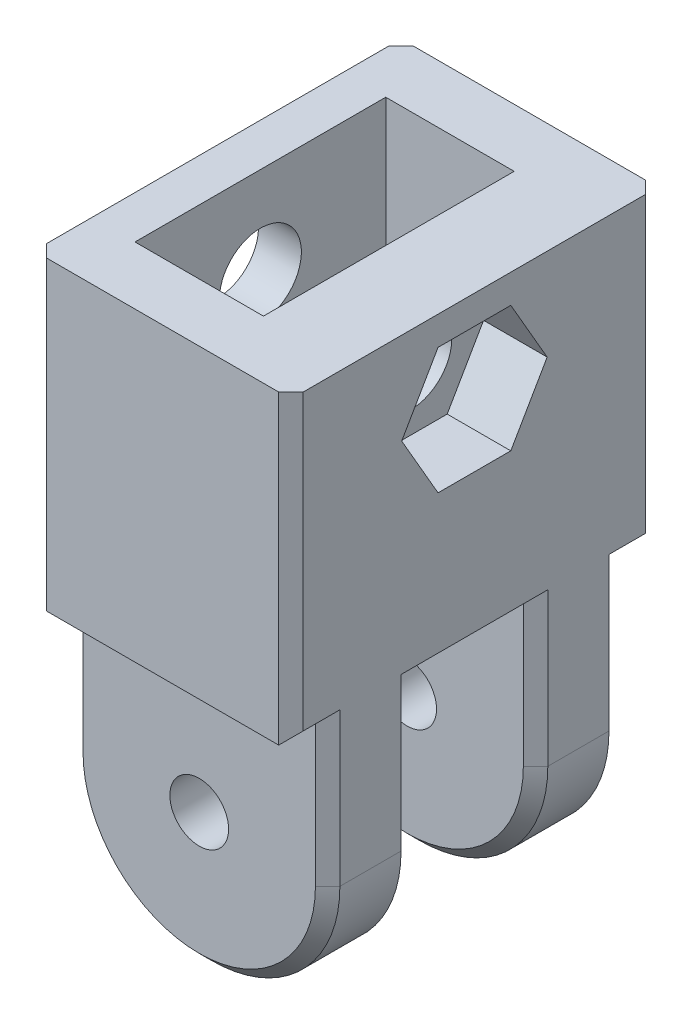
ISO-10303-21;
HEADER;
FILE_DESCRIPTION(('STEP AP214'),'2;1');
FILE_NAME('part.step','',(''),(''),'','','');
FILE_SCHEMA(('AUTOMOTIVE_DESIGN { 1 0 10303 214 1 1 1 1 }'));
ENDSEC;
DATA;
#1=APPLICATION_CONTEXT('core data for automotive mechanical design processes');
#2=APPLICATION_PROTOCOL_DEFINITION('international standard','automotive_design',2000,#1);
#3=PRODUCT_CONTEXT('',#1,'mechanical');
#4=PRODUCT('Part','Part','',(#3));
#5=PRODUCT_RELATED_PRODUCT_CATEGORY('part','',(#4));
#6=PRODUCT_DEFINITION_FORMATION('','',#4);
#7=PRODUCT_DEFINITION_CONTEXT('part definition',#1,'design');
#8=PRODUCT_DEFINITION('design','',#6,#7);
#9=PRODUCT_DEFINITION_SHAPE('','',#8);
#10=(LENGTH_UNIT() NAMED_UNIT(*) SI_UNIT(.MILLI.,.METRE.));
#11=(NAMED_UNIT(*) PLANE_ANGLE_UNIT() SI_UNIT($,.RADIAN.));
#12=(NAMED_UNIT(*) SI_UNIT($,.STERADIAN.) SOLID_ANGLE_UNIT());
#13=UNCERTAINTY_MEASURE_WITH_UNIT(LENGTH_MEASURE(1.E-05),#10,'distance_accuracy_value','');
#14=(GEOMETRIC_REPRESENTATION_CONTEXT(3) GLOBAL_UNCERTAINTY_ASSIGNED_CONTEXT((#13)) GLOBAL_UNIT_ASSIGNED_CONTEXT((#10,
#11,#12)) REPRESENTATION_CONTEXT('',''));
#15=CARTESIAN_POINT('',(0.,0.,0.));
#16=DIRECTION('',(0.,0.,1.));
#17=DIRECTION('',(1.,0.,0.));
#18=AXIS2_PLACEMENT_3D('',#15,#16,#17);
#19=CARTESIAN_POINT('',(-21.,0.,15.));
#20=DIRECTION('',(0.,1.,0.));
#21=DIRECTION('',(-1.,0.,0.));
#22=AXIS2_PLACEMENT_3D('',#19,#20,#21);
#23=PLANE('',#22);
#24=DIRECTION('',(1.,0.,0.));
#25=VECTOR('',#24,1.);
#26=CARTESIAN_POINT('',(-21.,0.,-12.));
#27=LINE('',#26,#25);
#28=CARTESIAN_POINT('',(-20.,0.,-12.));
#29=VERTEX_POINT('',#28);
#30=CARTESIAN_POINT('',(-1.00000000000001,0.,-12.));
#31=VERTEX_POINT('',#30);
#32=EDGE_CURVE('E641',#29,#31,#27,.T.);
#33=ORIENTED_EDGE('',*,*,#32,.F.);
#34=DIRECTION('',(0.,0.,-1.));
#35=VECTOR('',#34,1.);
#36=CARTESIAN_POINT('',(-20.,0.,15.));
#37=LINE('',#36,#35);
#38=CARTESIAN_POINT('',(-20.,0.,-15.));
#39=VERTEX_POINT('',#38);
#40=EDGE_CURVE('E453',#29,#39,#37,.T.);
#41=ORIENTED_EDGE('',*,*,#40,.T.);
#42=DIRECTION('',(1.,0.,0.));
#43=VECTOR('',#42,1.);
#44=CARTESIAN_POINT('',(-21.,0.,-15.));
#45=LINE('',#44,#43);
#46=CARTESIAN_POINT('',(-1.00000000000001,0.,-15.));
#47=VERTEX_POINT('',#46);
#48=EDGE_CURVE('E376',#39,#47,#45,.T.);
#49=ORIENTED_EDGE('',*,*,#48,.T.);
#50=DIRECTION('',(0.,0.,1.));
#51=VECTOR('',#50,1.);
#52=CARTESIAN_POINT('',(-1.00000000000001,0.,15.));
#53=LINE('',#52,#51);
#54=EDGE_CURVE('E451',#47,#31,#53,.T.);
#55=ORIENTED_EDGE('',*,*,#54,.T.);
#56=EDGE_LOOP('',(#33,#41,#49,#55));
#57=FACE_BOUND('',#56,.T.);
#58=ADVANCED_FACE('F36',(#57),#23,.F.);
#59=DIRECTION('',(1.,0.,0.));
#60=VECTOR('',#59,1.);
#61=CARTESIAN_POINT('',(-21.,0.,5.));
#62=LINE('',#61,#60);
#63=CARTESIAN_POINT('',(-20.,0.,5.));
#64=VERTEX_POINT('',#63);
#65=CARTESIAN_POINT('',(-1.,0.,5.));
#66=VERTEX_POINT('',#65);
#67=EDGE_CURVE('E634',#64,#66,#62,.T.);
#68=ORIENTED_EDGE('',*,*,#67,.F.);
#69=DIRECTION('',(0.,0.,-1.));
#70=VECTOR('',#69,1.);
#71=CARTESIAN_POINT('',(-20.,0.,15.));
#72=LINE('',#71,#70);
#73=CARTESIAN_POINT('',(-20.,0.,-5.));
#74=VERTEX_POINT('',#73);
#75=EDGE_CURVE('E429',#64,#74,#72,.T.);
#76=ORIENTED_EDGE('',*,*,#75,.T.);
#77=DIRECTION('',(-1.,0.,0.));
#78=VECTOR('',#77,1.);
#79=CARTESIAN_POINT('',(-21.,0.,-5.));
#80=LINE('',#79,#78);
#81=CARTESIAN_POINT('',(-1.,0.,-5.));
#82=VERTEX_POINT('',#81);
#83=EDGE_CURVE('E636',#82,#74,#80,.T.);
#84=ORIENTED_EDGE('',*,*,#83,.F.);
#85=DIRECTION('',(0.,0.,1.));
#86=VECTOR('',#85,1.);
#87=CARTESIAN_POINT('',(-1.,0.,15.));
#88=LINE('',#87,#86);
#89=EDGE_CURVE('E421',#82,#66,#88,.T.);
#90=ORIENTED_EDGE('',*,*,#89,.T.);
#91=EDGE_LOOP('',(#68,#76,#84,#90));
#92=FACE_BOUND('',#91,.T.);
#93=ADVANCED_FACE('F674',(#92),#23,.F.);
#94=DIRECTION('',(1.,0.,0.));
#95=VECTOR('',#94,1.);
#96=CARTESIAN_POINT('',(-21.,0.,15.));
#97=LINE('',#96,#95);
#98=CARTESIAN_POINT('',(-20.,0.,15.));
#99=VERTEX_POINT('',#98);
#100=CARTESIAN_POINT('',(-1.,0.,15.));
#101=VERTEX_POINT('',#100);
#102=EDGE_CURVE('E383',#99,#101,#97,.T.);
#103=ORIENTED_EDGE('',*,*,#102,.F.);
#104=DIRECTION('',(0.,0.,-1.));
#105=VECTOR('',#104,1.);
#106=CARTESIAN_POINT('',(-20.,0.,15.));
#107=LINE('',#106,#105);
#108=CARTESIAN_POINT('',(-20.,0.,12.));
#109=VERTEX_POINT('',#108);
#110=EDGE_CURVE('E470',#99,#109,#107,.T.);
#111=ORIENTED_EDGE('',*,*,#110,.T.);
#112=DIRECTION('',(-1.,0.,0.));
#113=VECTOR('',#112,1.);
#114=CARTESIAN_POINT('',(-21.,0.,12.));
#115=LINE('',#114,#113);
#116=CARTESIAN_POINT('',(-1.,0.,12.));
#117=VERTEX_POINT('',#116);
#118=EDGE_CURVE('E312',#117,#109,#115,.T.);
#119=ORIENTED_EDGE('',*,*,#118,.F.);
#120=DIRECTION('',(0.,0.,1.));
#121=VECTOR('',#120,1.);
#122=CARTESIAN_POINT('',(-1.,0.,15.));
#123=LINE('',#122,#121);
#124=EDGE_CURVE('E468',#117,#101,#123,.T.);
#125=ORIENTED_EDGE('',*,*,#124,.T.);
#126=EDGE_LOOP('',(#103,#111,#119,#125));
#127=FACE_BOUND('',#126,.T.);
#128=ADVANCED_FACE('F632',(#127),#23,.F.);
#129=CARTESIAN_POINT('',(0.,17.5,0.));
#130=DIRECTION('',(-1.,0.,0.));
#131=DIRECTION('',(0.,-1.,0.));
#132=AXIS2_PLACEMENT_3D('',#129,#130,#131);
#133=CYLINDRICAL_SURFACE('',#132,3.35);
#134=CARTESIAN_POINT('',(-7.,17.5,0.));
#135=DIRECTION('',(1.,0.,0.));
#136=DIRECTION('',(0.,0.,-1.));
#137=AXIS2_PLACEMENT_3D('',#134,#135,#136);
#138=CIRCLE('',#137,3.35);
#139=CARTESIAN_POINT('',(-7.,17.5,-3.35));
#140=VERTEX_POINT('',#139);
#141=EDGE_CURVE('E347',#140,#140,#138,.T.);
#142=ORIENTED_EDGE('',*,*,#141,.F.);
#143=EDGE_LOOP('',(#142));
#144=FACE_BOUND('',#143,.T.);
#145=CARTESIAN_POINT('',(-5.2,17.5,0.));
#146=DIRECTION('',(1.,0.,0.));
#147=DIRECTION('',(0.,0.,-1.));
#148=AXIS2_PLACEMENT_3D('',#145,#146,#147);
#149=CIRCLE('',#148,3.35);
#150=CARTESIAN_POINT('',(-5.2,17.5,-3.35));
#151=VERTEX_POINT('',#150);
#152=EDGE_CURVE('E335',#151,#151,#149,.F.);
#153=ORIENTED_EDGE('',*,*,#152,.F.);
#154=EDGE_LOOP('',(#153));
#155=FACE_BOUND('',#154,.T.);
#156=ADVANCED_FACE('F685',(#144,#155),#133,.F.);
#157=CARTESIAN_POINT('',(-21.,25.,15.));
#158=DIRECTION('',(1.,0.,0.));
#159=DIRECTION('',(0.,1.,0.));
#160=AXIS2_PLACEMENT_3D('',#157,#158,#159);
#161=PLANE('',#160);
#162=CARTESIAN_POINT('',(-21.,17.5,0.));
#163=DIRECTION('',(1.,0.,0.));
#164=DIRECTION('',(0.,1.,0.));
#165=AXIS2_PLACEMENT_3D('',#162,#163,#164);
#166=CIRCLE('',#165,3.35);
#167=CARTESIAN_POINT('',(-21.,20.85,0.));
#168=VERTEX_POINT('',#167);
#169=EDGE_CURVE('E346',#168,#168,#166,.T.);
#170=ORIENTED_EDGE('',*,*,#169,.T.);
#171=EDGE_LOOP('',(#170));
#172=FACE_BOUND('',#171,.T.);
#173=DIRECTION('',(0.,0.,-1.));
#174=VECTOR('',#173,1.);
#175=CARTESIAN_POINT('',(-21.,-11.5,15.));
#176=LINE('',#175,#174);
#177=CARTESIAN_POINT('',(-21.,-11.5,-11.));
#178=VERTEX_POINT('',#177);
#179=CARTESIAN_POINT('',(-21.,-11.5,-5.99999999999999));
#180=VERTEX_POINT('',#179);
#181=EDGE_CURVE('E412',#178,#180,#176,.F.);
#182=ORIENTED_EDGE('',*,*,#181,.T.);
#183=DIRECTION('',(0.,1.,0.));
#184=VECTOR('',#183,1.);
#185=CARTESIAN_POINT('',(-21.,25.,-5.99999999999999));
#186=LINE('',#185,#184);
#187=CARTESIAN_POINT('',(-21.,1.,-5.99999999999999));
#188=VERTEX_POINT('',#187);
#189=EDGE_CURVE('E449',#180,#188,#186,.T.);
#190=ORIENTED_EDGE('',*,*,#189,.T.);
#191=DIRECTION('',(0.,0.,1.));
#192=VECTOR('',#191,1.);
#193=CARTESIAN_POINT('',(-21.,1.,15.));
#194=LINE('',#193,#192);
#195=CARTESIAN_POINT('',(-21.,1.,5.99999999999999));
#196=VERTEX_POINT('',#195);
#197=EDGE_CURVE('E446',#188,#196,#194,.T.);
#198=ORIENTED_EDGE('',*,*,#197,.T.);
#199=DIRECTION('',(0.,-1.,0.));
#200=VECTOR('',#199,1.);
#201=CARTESIAN_POINT('',(-21.,25.,5.99999999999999));
#202=LINE('',#201,#200);
#203=CARTESIAN_POINT('',(-21.,-11.5,6.));
#204=VERTEX_POINT('',#203);
#205=EDGE_CURVE('E444',#196,#204,#202,.T.);
#206=ORIENTED_EDGE('',*,*,#205,.T.);
#207=DIRECTION('',(0.,0.,-1.));
#208=VECTOR('',#207,1.);
#209=CARTESIAN_POINT('',(-21.,-11.5,12.));
#210=LINE('',#209,#208);
#211=CARTESIAN_POINT('',(-21.,-11.5,11.));
#212=VERTEX_POINT('',#211);
#213=EDGE_CURVE('E400',#204,#212,#210,.F.);
#214=ORIENTED_EDGE('',*,*,#213,.T.);
#215=DIRECTION('',(0.,1.,0.));
#216=VECTOR('',#215,1.);
#217=CARTESIAN_POINT('',(-21.,25.,11.));
#218=LINE('',#217,#216);
#219=CARTESIAN_POINT('',(-21.,1.,11.));
#220=VERTEX_POINT('',#219);
#221=EDGE_CURVE('E432',#212,#220,#218,.T.);
#222=ORIENTED_EDGE('',*,*,#221,.T.);
#223=DIRECTION('',(0.,0.,1.));
#224=VECTOR('',#223,1.);
#225=CARTESIAN_POINT('',(-21.,1.,15.));
#226=LINE('',#225,#224);
#227=CARTESIAN_POINT('',(-21.,1.,14.));
#228=VERTEX_POINT('',#227);
#229=EDGE_CURVE('E434',#220,#228,#226,.T.);
#230=ORIENTED_EDGE('',*,*,#229,.T.);
#231=DIRECTION('',(0.,1.,0.));
#232=VECTOR('',#231,1.);
#233=CARTESIAN_POINT('',(-21.,25.,14.));
#234=LINE('',#233,#232);
#235=CARTESIAN_POINT('',(-21.,25.,14.));
#236=VERTEX_POINT('',#235);
#237=EDGE_CURVE('E436',#228,#236,#234,.T.);
#238=ORIENTED_EDGE('',*,*,#237,.T.);
#239=DIRECTION('',(0.,0.,-1.));
#240=VECTOR('',#239,1.);
#241=CARTESIAN_POINT('',(-21.,25.,15.));
#242=LINE('',#241,#240);
#243=CARTESIAN_POINT('',(-21.,25.,-14.));
#244=VERTEX_POINT('',#243);
#245=EDGE_CURVE('E390',#236,#244,#242,.T.);
#246=ORIENTED_EDGE('',*,*,#245,.T.);
#247=DIRECTION('',(0.,-1.,0.));
#248=VECTOR('',#247,1.);
#249=CARTESIAN_POINT('',(-21.,25.,-14.));
#250=LINE('',#249,#248);
#251=CARTESIAN_POINT('',(-21.,1.,-14.));
#252=VERTEX_POINT('',#251);
#253=EDGE_CURVE('E442',#244,#252,#250,.T.);
#254=ORIENTED_EDGE('',*,*,#253,.T.);
#255=DIRECTION('',(0.,0.,1.));
#256=VECTOR('',#255,1.);
#257=CARTESIAN_POINT('',(-21.,1.,15.));
#258=LINE('',#257,#256);
#259=CARTESIAN_POINT('',(-21.,1.,-11.));
#260=VERTEX_POINT('',#259);
#261=EDGE_CURVE('E440',#252,#260,#258,.T.);
#262=ORIENTED_EDGE('',*,*,#261,.T.);
#263=DIRECTION('',(0.,-1.,0.));
#264=VECTOR('',#263,1.);
#265=CARTESIAN_POINT('',(-21.,25.,-11.));
#266=LINE('',#265,#264);
#267=EDGE_CURVE('E438',#260,#178,#266,.T.);
#268=ORIENTED_EDGE('',*,*,#267,.T.);
#269=EDGE_LOOP('',(#182,#190,#198,#206,#214,#222,#230,#238,#246,#254,#262,#268));
#270=FACE_BOUND('',#269,.T.);
#271=ADVANCED_FACE('F689',(#172,#270),#161,.F.);
#272=CARTESIAN_POINT('',(0.,25.,15.));
#273=DIRECTION('',(-1.,0.,0.));
#274=DIRECTION('',(0.,0.,1.));
#275=AXIS2_PLACEMENT_3D('',#272,#273,#274);
#276=PLANE('',#275);
#277=DIRECTION('',(0.,0.,1.));
#278=VECTOR('',#277,1.);
#279=CARTESIAN_POINT('',(0.,22.65,-2.97335388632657));
#280=LINE('',#279,#278);
#281=CARTESIAN_POINT('',(0.,22.65,-2.97335388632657));
#282=VERTEX_POINT('',#281);
#283=CARTESIAN_POINT('',(0.,22.65,2.97335388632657));
#284=VERTEX_POINT('',#283);
#285=EDGE_CURVE('E323',#282,#284,#280,.T.);
#286=ORIENTED_EDGE('',*,*,#285,.F.);
#287=DIRECTION('',(0.,0.866025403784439,0.5));
#288=VECTOR('',#287,1.);
#289=CARTESIAN_POINT('',(0.,17.5,-5.94670777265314));
#290=LINE('',#289,#288);
#291=CARTESIAN_POINT('',(0.,17.5,-5.94670777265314));
#292=VERTEX_POINT('',#291);
#293=EDGE_CURVE('E287',#292,#282,#290,.T.);
#294=ORIENTED_EDGE('',*,*,#293,.F.);
#295=DIRECTION('',(0.,0.866025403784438,-0.5));
#296=VECTOR('',#295,1.);
#297=CARTESIAN_POINT('',(0.,12.35,-2.97335388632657));
#298=LINE('',#297,#296);
#299=CARTESIAN_POINT('',(0.,12.35,-2.97335388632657));
#300=VERTEX_POINT('',#299);
#301=EDGE_CURVE('E306',#300,#292,#298,.T.);
#302=ORIENTED_EDGE('',*,*,#301,.F.);
#303=DIRECTION('',(0.,0.,-1.));
#304=VECTOR('',#303,1.);
#305=CARTESIAN_POINT('',(0.,12.35,2.97335388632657));
#306=LINE('',#305,#304);
#307=CARTESIAN_POINT('',(0.,12.35,2.97335388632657));
#308=VERTEX_POINT('',#307);
#309=EDGE_CURVE('E309',#308,#300,#306,.T.);
#310=ORIENTED_EDGE('',*,*,#309,.F.);
#311=DIRECTION('',(0.,-0.866025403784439,-0.5));
#312=VECTOR('',#311,1.);
#313=CARTESIAN_POINT('',(0.,17.5,5.94670777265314));
#314=LINE('',#313,#312);
#315=CARTESIAN_POINT('',(0.,17.5,5.94670777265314));
#316=VERTEX_POINT('',#315);
#317=EDGE_CURVE('E328',#316,#308,#314,.T.);
#318=ORIENTED_EDGE('',*,*,#317,.F.);
#319=DIRECTION('',(0.,-0.866025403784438,0.5));
#320=VECTOR('',#319,1.);
#321=CARTESIAN_POINT('',(0.,22.65,2.97335388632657));
#322=LINE('',#321,#320);
#323=EDGE_CURVE('E325',#284,#316,#322,.T.);
#324=ORIENTED_EDGE('',*,*,#323,.F.);
#325=EDGE_LOOP('',(#286,#294,#302,#310,#318,#324));
#326=FACE_BOUND('',#325,.T.);
#327=DIRECTION('',(0.,0.,-1.));
#328=VECTOR('',#327,1.);
#329=CARTESIAN_POINT('',(0.,0.999999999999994,15.));
#330=LINE('',#329,#328);
#331=CARTESIAN_POINT('',(0.,0.999999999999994,6.));
#332=VERTEX_POINT('',#331);
#333=CARTESIAN_POINT('',(0.,0.999999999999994,-6.));
#334=VERTEX_POINT('',#333);
#335=EDGE_CURVE('E523',#332,#334,#330,.T.);
#336=ORIENTED_EDGE('',*,*,#335,.T.);
#337=DIRECTION('',(0.,-1.,0.));
#338=VECTOR('',#337,1.);
#339=CARTESIAN_POINT('',(0.,25.,-6.));
#340=LINE('',#339,#338);
#341=CARTESIAN_POINT('',(0.,-11.5,-6.));
#342=VERTEX_POINT('',#341);
#343=EDGE_CURVE('E525',#334,#342,#340,.T.);
#344=ORIENTED_EDGE('',*,*,#343,.T.);
#345=DIRECTION('',(0.,0.,1.));
#346=VECTOR('',#345,1.);
#347=CARTESIAN_POINT('',(0.,-11.5,15.));
#348=LINE('',#347,#346);
#349=CARTESIAN_POINT('',(0.,-11.5,-11.));
#350=VERTEX_POINT('',#349);
#351=EDGE_CURVE('E418',#342,#350,#348,.F.);
#352=ORIENTED_EDGE('',*,*,#351,.T.);
#353=DIRECTION('',(0.,1.,0.));
#354=VECTOR('',#353,1.);
#355=CARTESIAN_POINT('',(0.,25.,-11.));
#356=LINE('',#355,#354);
#357=CARTESIAN_POINT('',(0.,1.,-11.));
#358=VERTEX_POINT('',#357);
#359=EDGE_CURVE('E519',#350,#358,#356,.T.);
#360=ORIENTED_EDGE('',*,*,#359,.T.);
#361=DIRECTION('',(0.,0.,-1.));
#362=VECTOR('',#361,1.);
#363=CARTESIAN_POINT('',(0.,1.,15.));
#364=LINE('',#363,#362);
#365=CARTESIAN_POINT('',(0.,1.,-14.));
#366=VERTEX_POINT('',#365);
#367=EDGE_CURVE('E517',#358,#366,#364,.T.);
#368=ORIENTED_EDGE('',*,*,#367,.T.);
#369=DIRECTION('',(0.,1.,0.));
#370=VECTOR('',#369,1.);
#371=CARTESIAN_POINT('',(0.,25.,-14.));
#372=LINE('',#371,#370);
#373=CARTESIAN_POINT('',(0.,25.,-14.));
#374=VERTEX_POINT('',#373);
#375=EDGE_CURVE('E515',#366,#374,#372,.T.);
#376=ORIENTED_EDGE('',*,*,#375,.T.);
#377=DIRECTION('',(0.,0.,-1.));
#378=VECTOR('',#377,1.);
#379=CARTESIAN_POINT('',(0.,25.,15.));
#380=LINE('',#379,#378);
#381=CARTESIAN_POINT('',(0.,25.,14.));
#382=VERTEX_POINT('',#381);
#383=EDGE_CURVE('E397',#382,#374,#380,.T.);
#384=ORIENTED_EDGE('',*,*,#383,.F.);
#385=DIRECTION('',(0.,-1.,0.));
#386=VECTOR('',#385,1.);
#387=CARTESIAN_POINT('',(0.,0.,14.));
#388=LINE('',#387,#386);
#389=CARTESIAN_POINT('',(0.,1.00000000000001,14.));
#390=VERTEX_POINT('',#389);
#391=EDGE_CURVE('E509',#382,#390,#388,.T.);
#392=ORIENTED_EDGE('',*,*,#391,.T.);
#393=DIRECTION('',(0.,0.,-1.));
#394=VECTOR('',#393,1.);
#395=CARTESIAN_POINT('',(0.,1.00000000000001,15.));
#396=LINE('',#395,#394);
#397=CARTESIAN_POINT('',(0.,1.00000000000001,11.));
#398=VERTEX_POINT('',#397);
#399=EDGE_CURVE('E511',#390,#398,#396,.T.);
#400=ORIENTED_EDGE('',*,*,#399,.T.);
#401=DIRECTION('',(0.,-1.,0.));
#402=VECTOR('',#401,1.);
#403=CARTESIAN_POINT('',(0.,25.,11.));
#404=LINE('',#403,#402);
#405=CARTESIAN_POINT('',(0.,-11.5,11.));
#406=VERTEX_POINT('',#405);
#407=EDGE_CURVE('E513',#398,#406,#404,.T.);
#408=ORIENTED_EDGE('',*,*,#407,.T.);
#409=DIRECTION('',(0.,0.,1.));
#410=VECTOR('',#409,1.);
#411=CARTESIAN_POINT('',(0.,-11.5,5.));
#412=LINE('',#411,#410);
#413=CARTESIAN_POINT('',(0.,-11.5,6.));
#414=VERTEX_POINT('',#413);
#415=EDGE_CURVE('E415',#406,#414,#412,.F.);
#416=ORIENTED_EDGE('',*,*,#415,.T.);
#417=DIRECTION('',(0.,1.,0.));
#418=VECTOR('',#417,1.);
#419=CARTESIAN_POINT('',(0.,25.,6.));
#420=LINE('',#419,#418);
#421=EDGE_CURVE('E521',#414,#332,#420,.T.);
#422=ORIENTED_EDGE('',*,*,#421,.T.);
#423=EDGE_LOOP('',(#336,#344,#352,#360,#368,#376,#384,#392,#400,#408,#416,#422));
#424=FACE_BOUND('',#423,.T.);
#425=ADVANCED_FACE('F696',(#326,#424),#276,.F.);
#426=CARTESIAN_POINT('',(-21.,25.,15.));
#427=DIRECTION('',(0.,-1.,0.));
#428=DIRECTION('',(1.,0.,0.));
#429=AXIS2_PLACEMENT_3D('',#426,#427,#428);
#430=PLANE('',#429);
#431=DIRECTION('',(1.,0.,0.));
#432=VECTOR('',#431,1.);
#433=CARTESIAN_POINT('',(-17.5,25.,10.25));
#434=LINE('',#433,#432);
#435=CARTESIAN_POINT('',(-17.5,25.,10.25));
#436=VERTEX_POINT('',#435);
#437=CARTESIAN_POINT('',(-7.,25.,10.25));
#438=VERTEX_POINT('',#437);
#439=EDGE_CURVE('E366',#436,#438,#434,.T.);
#440=ORIENTED_EDGE('',*,*,#439,.F.);
#441=DIRECTION('',(0.,0.,1.));
#442=VECTOR('',#441,1.);
#443=CARTESIAN_POINT('',(-17.5,25.,-10.25));
#444=LINE('',#443,#442);
#445=CARTESIAN_POINT('',(-17.5,25.,-10.25));
#446=VERTEX_POINT('',#445);
#447=EDGE_CURVE('E350',#446,#436,#444,.T.);
#448=ORIENTED_EDGE('',*,*,#447,.F.);
#449=DIRECTION('',(-1.,0.,0.));
#450=VECTOR('',#449,1.);
#451=CARTESIAN_POINT('',(-17.5,25.,-10.25));
#452=LINE('',#451,#450);
#453=CARTESIAN_POINT('',(-7.,25.,-10.25));
#454=VERTEX_POINT('',#453);
#455=EDGE_CURVE('E355',#454,#446,#452,.T.);
#456=ORIENTED_EDGE('',*,*,#455,.F.);
#457=DIRECTION('',(0.,0.,-1.));
#458=VECTOR('',#457,1.);
#459=CARTESIAN_POINT('',(-7.,25.,-10.25));
#460=LINE('',#459,#458);
#461=EDGE_CURVE('E369',#438,#454,#460,.T.);
#462=ORIENTED_EDGE('',*,*,#461,.F.);
#463=EDGE_LOOP('',(#440,#448,#456,#462));
#464=FACE_BOUND('',#463,.T.);
#465=DIRECTION('',(-1.,0.,0.));
#466=VECTOR('',#465,1.);
#467=CARTESIAN_POINT('',(-21.,25.,-15.));
#468=LINE('',#467,#466);
#469=CARTESIAN_POINT('',(-1.00000000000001,25.,-15.));
#470=VERTEX_POINT('',#469);
#471=CARTESIAN_POINT('',(-20.,25.,-15.));
#472=VERTEX_POINT('',#471);
#473=EDGE_CURVE('E387',#470,#472,#468,.T.);
#474=ORIENTED_EDGE('',*,*,#473,.T.);
#475=DIRECTION('',(0.707106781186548,0.,-0.707106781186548));
#476=VECTOR('',#475,1.);
#477=CARTESIAN_POINT('',(-21.,25.,-14.));
#478=LINE('',#477,#476);
#479=EDGE_CURVE('E466',#472,#244,#478,.F.);
#480=ORIENTED_EDGE('',*,*,#479,.T.);
#481=ORIENTED_EDGE('',*,*,#245,.F.);
#482=DIRECTION('',(0.707106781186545,0.,0.70710678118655));
#483=VECTOR('',#482,1.);
#484=CARTESIAN_POINT('',(-20.,25.,15.));
#485=LINE('',#484,#483);
#486=CARTESIAN_POINT('',(-20.,25.,15.));
#487=VERTEX_POINT('',#486);
#488=EDGE_CURVE('E464',#236,#487,#485,.T.);
#489=ORIENTED_EDGE('',*,*,#488,.T.);
#490=DIRECTION('',(-1.,0.,0.));
#491=VECTOR('',#490,1.);
#492=CARTESIAN_POINT('',(-21.,25.,15.));
#493=LINE('',#492,#491);
#494=CARTESIAN_POINT('',(-1.,25.,15.));
#495=VERTEX_POINT('',#494);
#496=EDGE_CURVE('E386',#495,#487,#493,.T.);
#497=ORIENTED_EDGE('',*,*,#496,.F.);
#498=DIRECTION('',(0.707106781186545,0.,-0.70710678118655));
#499=VECTOR('',#498,1.);
#500=CARTESIAN_POINT('',(-1.00000000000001,25.,15.));
#501=LINE('',#500,#499);
#502=EDGE_CURVE('E460',#495,#382,#501,.T.);
#503=ORIENTED_EDGE('',*,*,#502,.T.);
#504=ORIENTED_EDGE('',*,*,#383,.T.);
#505=DIRECTION('',(0.70710678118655,0.,0.707106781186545));
#506=VECTOR('',#505,1.);
#507=CARTESIAN_POINT('',(0.,25.,-14.));
#508=LINE('',#507,#506);
#509=EDGE_CURVE('E462',#374,#470,#508,.F.);
#510=ORIENTED_EDGE('',*,*,#509,.T.);
#511=EDGE_LOOP('',(#474,#480,#481,#489,#497,#503,#504,#510));
#512=FACE_BOUND('',#511,.T.);
#513=ADVANCED_FACE('F622',(#464,#512),#430,.F.);
#514=CARTESIAN_POINT('',(0.,0.,15.));
#515=DIRECTION('',(0.,0.,1.));
#516=DIRECTION('',(1.,0.,0.));
#517=AXIS2_PLACEMENT_3D('',#514,#515,#516);
#518=PLANE('',#517);
#519=ORIENTED_EDGE('',*,*,#496,.T.);
#520=DIRECTION('',(0.,-1.,0.));
#521=VECTOR('',#520,1.);
#522=CARTESIAN_POINT('',(-20.,0.,15.));
#523=LINE('',#522,#521);
#524=EDGE_CURVE('E475',#487,#99,#523,.T.);
#525=ORIENTED_EDGE('',*,*,#524,.T.);
#526=ORIENTED_EDGE('',*,*,#102,.T.);
#527=DIRECTION('',(0.,1.,0.));
#528=VECTOR('',#527,1.);
#529=CARTESIAN_POINT('',(-1.,25.,15.));
#530=LINE('',#529,#528);
#531=EDGE_CURVE('E473',#101,#495,#530,.T.);
#532=ORIENTED_EDGE('',*,*,#531,.T.);
#533=EDGE_LOOP('',(#519,#525,#526,#532));
#534=FACE_BOUND('',#533,.T.);
#535=ADVANCED_FACE('F618',(#534),#518,.T.);
#536=CARTESIAN_POINT('',(0.,0.,-15.));
#537=DIRECTION('',(0.,0.,1.));
#538=DIRECTION('',(1.,0.,0.));
#539=AXIS2_PLACEMENT_3D('',#536,#537,#538);
#540=PLANE('',#539);
#541=ORIENTED_EDGE('',*,*,#48,.F.);
#542=DIRECTION('',(0.,1.,0.));
#543=VECTOR('',#542,1.);
#544=CARTESIAN_POINT('',(-20.,0.,-15.));
#545=LINE('',#544,#543);
#546=EDGE_CURVE('E458',#39,#472,#545,.T.);
#547=ORIENTED_EDGE('',*,*,#546,.T.);
#548=ORIENTED_EDGE('',*,*,#473,.F.);
#549=DIRECTION('',(0.,-1.,0.));
#550=VECTOR('',#549,1.);
#551=CARTESIAN_POINT('',(-1.00000000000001,0.,-15.));
#552=LINE('',#551,#550);
#553=EDGE_CURVE('E456',#470,#47,#552,.T.);
#554=ORIENTED_EDGE('',*,*,#553,.T.);
#555=EDGE_LOOP('',(#541,#547,#548,#554));
#556=FACE_BOUND('',#555,.T.);
#557=ADVANCED_FACE('F799',(#556),#540,.F.);
#558=CARTESIAN_POINT('',(-17.5,6.50000000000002,-10.25));
#559=DIRECTION('',(-1.,0.,0.));
#560=DIRECTION('',(0.,0.,1.));
#561=AXIS2_PLACEMENT_3D('',#558,#559,#560);
#562=PLANE('',#561);
#563=CARTESIAN_POINT('',(-17.5,17.5,0.));
#564=DIRECTION('',(-1.,0.,0.));
#565=DIRECTION('',(0.,0.,1.));
#566=AXIS2_PLACEMENT_3D('',#563,#564,#565);
#567=CIRCLE('',#566,3.35);
#568=CARTESIAN_POINT('',(-17.5,17.5,3.35));
#569=VERTEX_POINT('',#568);
#570=EDGE_CURVE('E343',#569,#569,#567,.T.);
#571=ORIENTED_EDGE('',*,*,#570,.T.);
#572=EDGE_LOOP('',(#571));
#573=FACE_BOUND('',#572,.T.);
#574=ORIENTED_EDGE('',*,*,#447,.T.);
#575=DIRECTION('',(0.,1.,0.));
#576=VECTOR('',#575,1.);
#577=CARTESIAN_POINT('',(-17.5,6.50000000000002,10.25));
#578=LINE('',#577,#576);
#579=CARTESIAN_POINT('',(-17.5,6.50000000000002,10.25));
#580=VERTEX_POINT('',#579);
#581=EDGE_CURVE('E364',#580,#436,#578,.T.);
#582=ORIENTED_EDGE('',*,*,#581,.F.);
#583=DIRECTION('',(0.,0.,1.));
#584=VECTOR('',#583,1.);
#585=CARTESIAN_POINT('',(-17.5,6.50000000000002,-10.25));
#586=LINE('',#585,#584);
#587=CARTESIAN_POINT('',(-17.5,6.50000000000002,-10.25));
#588=VERTEX_POINT('',#587);
#589=EDGE_CURVE('E351',#588,#580,#586,.T.);
#590=ORIENTED_EDGE('',*,*,#589,.F.);
#591=DIRECTION('',(0.,1.,0.));
#592=VECTOR('',#591,1.);
#593=CARTESIAN_POINT('',(-17.5,6.50000000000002,-10.25));
#594=LINE('',#593,#592);
#595=EDGE_CURVE('E374',#588,#446,#594,.T.);
#596=ORIENTED_EDGE('',*,*,#595,.T.);
#597=EDGE_LOOP('',(#574,#582,#590,#596));
#598=FACE_BOUND('',#597,.T.);
#599=ADVANCED_FACE('F1219',(#573,#598),#562,.F.);
#600=CARTESIAN_POINT('',(-17.5,6.50000000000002,-10.25));
#601=DIRECTION('',(0.,0.,-1.));
#602=DIRECTION('',(-1.,0.,0.));
#603=AXIS2_PLACEMENT_3D('',#600,#601,#602);
#604=PLANE('',#603);
#605=ORIENTED_EDGE('',*,*,#455,.T.);
#606=ORIENTED_EDGE('',*,*,#595,.F.);
#607=DIRECTION('',(-1.,0.,0.));
#608=VECTOR('',#607,1.);
#609=CARTESIAN_POINT('',(-17.5,6.50000000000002,-10.25));
#610=LINE('',#609,#608);
#611=CARTESIAN_POINT('',(-7.,6.50000000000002,-10.25));
#612=VERTEX_POINT('',#611);
#613=EDGE_CURVE('E361',#612,#588,#610,.T.);
#614=ORIENTED_EDGE('',*,*,#613,.F.);
#615=DIRECTION('',(0.,1.,0.));
#616=VECTOR('',#615,1.);
#617=CARTESIAN_POINT('',(-7.,6.50000000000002,-10.25));
#618=LINE('',#617,#616);
#619=EDGE_CURVE('E377',#612,#454,#618,.T.);
#620=ORIENTED_EDGE('',*,*,#619,.T.);
#621=EDGE_LOOP('',(#605,#606,#614,#620));
#622=FACE_BOUND('',#621,.T.);
#623=ADVANCED_FACE('F1229',(#622),#604,.F.);
#624=CARTESIAN_POINT('',(-7.,6.50000000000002,-10.25));
#625=DIRECTION('',(1.,0.,0.));
#626=DIRECTION('',(0.,0.,-1.));
#627=AXIS2_PLACEMENT_3D('',#624,#625,#626);
#628=PLANE('',#627);
#629=ORIENTED_EDGE('',*,*,#141,.T.);
#630=EDGE_LOOP('',(#629));
#631=FACE_BOUND('',#630,.T.);
#632=ORIENTED_EDGE('',*,*,#461,.T.);
#633=ORIENTED_EDGE('',*,*,#619,.F.);
#634=DIRECTION('',(0.,0.,-1.));
#635=VECTOR('',#634,1.);
#636=CARTESIAN_POINT('',(-7.,6.50000000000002,-10.25));
#637=LINE('',#636,#635);
#638=CARTESIAN_POINT('',(-7.,6.50000000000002,10.25));
#639=VERTEX_POINT('',#638);
#640=EDGE_CURVE('E358',#639,#612,#637,.T.);
#641=ORIENTED_EDGE('',*,*,#640,.F.);
#642=DIRECTION('',(0.,1.,0.));
#643=VECTOR('',#642,1.);
#644=CARTESIAN_POINT('',(-7.,6.50000000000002,10.25));
#645=LINE('',#644,#643);
#646=EDGE_CURVE('E379',#639,#438,#645,.T.);
#647=ORIENTED_EDGE('',*,*,#646,.T.);
#648=EDGE_LOOP('',(#632,#633,#641,#647));
#649=FACE_BOUND('',#648,.T.);
#650=ADVANCED_FACE('F1238',(#631,#649),#628,.F.);
#651=CARTESIAN_POINT('',(-17.5,6.50000000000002,10.25));
#652=DIRECTION('',(0.,0.,1.));
#653=DIRECTION('',(1.,0.,0.));
#654=AXIS2_PLACEMENT_3D('',#651,#652,#653);
#655=PLANE('',#654);
#656=ORIENTED_EDGE('',*,*,#439,.T.);
#657=ORIENTED_EDGE('',*,*,#646,.F.);
#658=DIRECTION('',(1.,0.,0.));
#659=VECTOR('',#658,1.);
#660=CARTESIAN_POINT('',(-17.5,6.50000000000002,10.25));
#661=LINE('',#660,#659);
#662=EDGE_CURVE('E354',#580,#639,#661,.T.);
#663=ORIENTED_EDGE('',*,*,#662,.F.);
#664=ORIENTED_EDGE('',*,*,#581,.T.);
#665=EDGE_LOOP('',(#656,#657,#663,#664));
#666=FACE_BOUND('',#665,.T.);
#667=ADVANCED_FACE('F710',(#666),#655,.F.);
#668=CARTESIAN_POINT('',(0.,6.50000000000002,0.));
#669=DIRECTION('',(0.,1.,0.));
#670=DIRECTION('',(0.,0.,1.));
#671=AXIS2_PLACEMENT_3D('',#668,#669,#670);
#672=PLANE('',#671);
#673=ORIENTED_EDGE('',*,*,#589,.T.);
#674=ORIENTED_EDGE('',*,*,#662,.T.);
#675=ORIENTED_EDGE('',*,*,#640,.T.);
#676=ORIENTED_EDGE('',*,*,#613,.T.);
#677=EDGE_LOOP('',(#673,#674,#675,#676));
#678=FACE_BOUND('',#677,.T.);
#679=ADVANCED_FACE('F703',(#678),#672,.T.);
#680=ORIENTED_EDGE('',*,*,#570,.F.);
#681=EDGE_LOOP('',(#680));
#682=FACE_BOUND('',#681,.T.);
#683=ORIENTED_EDGE('',*,*,#169,.F.);
#684=EDGE_LOOP('',(#683));
#685=FACE_BOUND('',#684,.T.);
#686=ADVANCED_FACE('F692',(#682,#685),#133,.F.);
#687=CARTESIAN_POINT('',(-5.2,0.,0.));
#688=DIRECTION('',(1.,0.,0.));
#689=DIRECTION('',(0.,0.,-1.));
#690=AXIS2_PLACEMENT_3D('',#687,#688,#689);
#691=PLANE('',#690);
#692=DIRECTION('',(0.,0.866025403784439,0.5));
#693=VECTOR('',#692,1.);
#694=CARTESIAN_POINT('',(-5.2,17.5,-5.94670777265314));
#695=LINE('',#694,#693);
#696=CARTESIAN_POINT('',(-5.2,17.5,-5.94670777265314));
#697=VERTEX_POINT('',#696);
#698=CARTESIAN_POINT('',(-5.2,22.65,-2.97335388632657));
#699=VERTEX_POINT('',#698);
#700=EDGE_CURVE('E284',#697,#699,#695,.T.);
#701=ORIENTED_EDGE('',*,*,#700,.T.);
#702=DIRECTION('',(0.,0.,1.));
#703=VECTOR('',#702,1.);
#704=CARTESIAN_POINT('',(-5.2,22.65,-2.97335388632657));
#705=LINE('',#704,#703);
#706=CARTESIAN_POINT('',(-5.2,22.65,2.97335388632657));
#707=VERTEX_POINT('',#706);
#708=EDGE_CURVE('E295',#699,#707,#705,.T.);
#709=ORIENTED_EDGE('',*,*,#708,.T.);
#710=DIRECTION('',(0.,-0.866025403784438,0.5));
#711=VECTOR('',#710,1.);
#712=CARTESIAN_POINT('',(-5.2,22.65,2.97335388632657));
#713=LINE('',#712,#711);
#714=CARTESIAN_POINT('',(-5.2,17.5,5.94670777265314));
#715=VERTEX_POINT('',#714);
#716=EDGE_CURVE('E300',#707,#715,#713,.T.);
#717=ORIENTED_EDGE('',*,*,#716,.T.);
#718=DIRECTION('',(0.,-0.866025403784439,-0.5));
#719=VECTOR('',#718,1.);
#720=CARTESIAN_POINT('',(-5.2,17.5,5.94670777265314));
#721=LINE('',#720,#719);
#722=CARTESIAN_POINT('',(-5.2,12.35,2.97335388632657));
#723=VERTEX_POINT('',#722);
#724=EDGE_CURVE('E316',#715,#723,#721,.T.);
#725=ORIENTED_EDGE('',*,*,#724,.T.);
#726=DIRECTION('',(0.,0.,-1.));
#727=VECTOR('',#726,1.);
#728=CARTESIAN_POINT('',(-5.2,12.35,2.97335388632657));
#729=LINE('',#728,#727);
#730=CARTESIAN_POINT('',(-5.2,12.35,-2.97335388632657));
#731=VERTEX_POINT('',#730);
#732=EDGE_CURVE('E319',#723,#731,#729,.T.);
#733=ORIENTED_EDGE('',*,*,#732,.T.);
#734=DIRECTION('',(0.,0.866025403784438,-0.5));
#735=VECTOR('',#734,1.);
#736=CARTESIAN_POINT('',(-5.2,12.35,-2.97335388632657));
#737=LINE('',#736,#735);
#738=EDGE_CURVE('E292',#731,#697,#737,.T.);
#739=ORIENTED_EDGE('',*,*,#738,.T.);
#740=EDGE_LOOP('',(#701,#709,#717,#725,#733,#739));
#741=FACE_BOUND('',#740,.T.);
#742=ORIENTED_EDGE('',*,*,#152,.T.);
#743=EDGE_LOOP('',(#742));
#744=FACE_BOUND('',#743,.T.);
#745=ADVANCED_FACE('F302',(#741,#744),#691,.T.);
#746=CARTESIAN_POINT('',(-5.2,17.5,-5.94670777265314));
#747=DIRECTION('',(0.,0.5,-0.866025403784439));
#748=DIRECTION('',(0.,0.866025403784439,0.5));
#749=AXIS2_PLACEMENT_3D('',#746,#747,#748);
#750=PLANE('',#749);
#751=ORIENTED_EDGE('',*,*,#293,.T.);
#752=DIRECTION('',(1.,0.,0.));
#753=VECTOR('',#752,1.);
#754=CARTESIAN_POINT('',(-5.2,22.65,-2.97335388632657));
#755=LINE('',#754,#753);
#756=EDGE_CURVE('E280',#699,#282,#755,.T.);
#757=ORIENTED_EDGE('',*,*,#756,.F.);
#758=ORIENTED_EDGE('',*,*,#700,.F.);
#759=DIRECTION('',(1.,0.,0.));
#760=VECTOR('',#759,1.);
#761=CARTESIAN_POINT('',(-5.2,17.5,-5.94670777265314));
#762=LINE('',#761,#760);
#763=EDGE_CURVE('E333',#697,#292,#762,.T.);
#764=ORIENTED_EDGE('',*,*,#763,.T.);
#765=EDGE_LOOP('',(#751,#757,#758,#764));
#766=FACE_BOUND('',#765,.T.);
#767=ADVANCED_FACE('F282',(#766),#750,.F.);
#768=CARTESIAN_POINT('',(-5.2,12.35,-2.97335388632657));
#769=DIRECTION('',(0.,-0.5,-0.866025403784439));
#770=DIRECTION('',(0.,0.866025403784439,-0.5));
#771=AXIS2_PLACEMENT_3D('',#768,#769,#770);
#772=PLANE('',#771);
#773=ORIENTED_EDGE('',*,*,#301,.T.);
#774=ORIENTED_EDGE('',*,*,#763,.F.);
#775=ORIENTED_EDGE('',*,*,#738,.F.);
#776=DIRECTION('',(1.,0.,0.));
#777=VECTOR('',#776,1.);
#778=CARTESIAN_POINT('',(-5.2,12.35,-2.97335388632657));
#779=LINE('',#778,#777);
#780=EDGE_CURVE('E336',#731,#300,#779,.T.);
#781=ORIENTED_EDGE('',*,*,#780,.T.);
#782=EDGE_LOOP('',(#773,#774,#775,#781));
#783=FACE_BOUND('',#782,.T.);
#784=ADVANCED_FACE('F1281',(#783),#772,.F.);
#785=CARTESIAN_POINT('',(-5.2,12.35,2.97335388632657));
#786=DIRECTION('',(0.,-1.,0.));
#787=DIRECTION('',(0.,0.,-1.));
#788=AXIS2_PLACEMENT_3D('',#785,#786,#787);
#789=PLANE('',#788);
#790=ORIENTED_EDGE('',*,*,#309,.T.);
#791=ORIENTED_EDGE('',*,*,#780,.F.);
#792=ORIENTED_EDGE('',*,*,#732,.F.);
#793=DIRECTION('',(1.,0.,0.));
#794=VECTOR('',#793,1.);
#795=CARTESIAN_POINT('',(-5.2,12.35,2.97335388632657));
#796=LINE('',#795,#794);
#797=EDGE_CURVE('E338',#723,#308,#796,.T.);
#798=ORIENTED_EDGE('',*,*,#797,.T.);
#799=EDGE_LOOP('',(#790,#791,#792,#798));
#800=FACE_BOUND('',#799,.T.);
#801=ADVANCED_FACE('F1288',(#800),#789,.F.);
#802=CARTESIAN_POINT('',(-5.2,17.5,5.94670777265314));
#803=DIRECTION('',(0.,-0.5,0.866025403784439));
#804=DIRECTION('',(0.,-0.866025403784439,-0.5));
#805=AXIS2_PLACEMENT_3D('',#802,#803,#804);
#806=PLANE('',#805);
#807=ORIENTED_EDGE('',*,*,#317,.T.);
#808=ORIENTED_EDGE('',*,*,#797,.F.);
#809=ORIENTED_EDGE('',*,*,#724,.F.);
#810=DIRECTION('',(1.,0.,0.));
#811=VECTOR('',#810,1.);
#812=CARTESIAN_POINT('',(-5.2,17.5,5.94670777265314));
#813=LINE('',#812,#811);
#814=EDGE_CURVE('E340',#715,#316,#813,.T.);
#815=ORIENTED_EDGE('',*,*,#814,.T.);
#816=EDGE_LOOP('',(#807,#808,#809,#815));
#817=FACE_BOUND('',#816,.T.);
#818=ADVANCED_FACE('F1297',(#817),#806,.F.);
#819=CARTESIAN_POINT('',(-5.2,22.65,2.97335388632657));
#820=DIRECTION('',(0.,0.5,0.866025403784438));
#821=DIRECTION('',(0.,-0.866025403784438,0.5));
#822=AXIS2_PLACEMENT_3D('',#819,#820,#821);
#823=PLANE('',#822);
#824=ORIENTED_EDGE('',*,*,#323,.T.);
#825=ORIENTED_EDGE('',*,*,#814,.F.);
#826=ORIENTED_EDGE('',*,*,#716,.F.);
#827=DIRECTION('',(1.,0.,0.));
#828=VECTOR('',#827,1.);
#829=CARTESIAN_POINT('',(-5.2,22.65,2.97335388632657));
#830=LINE('',#829,#828);
#831=EDGE_CURVE('E291',#707,#284,#830,.T.);
#832=ORIENTED_EDGE('',*,*,#831,.T.);
#833=EDGE_LOOP('',(#824,#825,#826,#832));
#834=FACE_BOUND('',#833,.T.);
#835=ADVANCED_FACE('F1306',(#834),#823,.F.);
#836=CARTESIAN_POINT('',(-5.2,22.65,-2.97335388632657));
#837=DIRECTION('',(0.,1.,0.));
#838=DIRECTION('',(0.,0.,1.));
#839=AXIS2_PLACEMENT_3D('',#836,#837,#838);
#840=PLANE('',#839);
#841=ORIENTED_EDGE('',*,*,#285,.T.);
#842=ORIENTED_EDGE('',*,*,#831,.F.);
#843=ORIENTED_EDGE('',*,*,#708,.F.);
#844=ORIENTED_EDGE('',*,*,#756,.T.);
#845=EDGE_LOOP('',(#841,#842,#843,#844));
#846=FACE_BOUND('',#845,.T.);
#847=ADVANCED_FACE('F296',(#846),#840,.F.);
#848=CARTESIAN_POINT('',(-21.,-22.,5.));
#849=DIRECTION('',(0.,0.,1.));
#850=DIRECTION('',(1.,0.,0.));
#851=AXIS2_PLACEMENT_3D('',#848,#849,#850);
#852=PLANE('',#851);
#853=CARTESIAN_POINT('',(-10.5,-11.,5.));
#854=DIRECTION('',(0.,0.,1.));
#855=DIRECTION('',(1.,0.,0.));
#856=AXIS2_PLACEMENT_3D('',#853,#854,#855);
#857=CIRCLE('',#856,2.4);
#858=CARTESIAN_POINT('',(-8.1,-11.,5.));
#859=VERTEX_POINT('',#858);
#860=EDGE_CURVE('E646',#859,#859,#857,.T.);
#861=ORIENTED_EDGE('',*,*,#860,.T.);
#862=EDGE_LOOP('',(#861));
#863=FACE_BOUND('',#862,.T.);
#864=CARTESIAN_POINT('',(-10.5,-11.5,5.));
#865=DIRECTION('',(0.,0.,1.));
#866=DIRECTION('',(1.,0.,0.));
#867=AXIS2_PLACEMENT_3D('',#864,#865,#866);
#868=CIRCLE('',#867,9.5);
#869=CARTESIAN_POINT('',(-10.5,-21.,5.));
#870=VERTEX_POINT('',#869);
#871=CARTESIAN_POINT('',(-20.,-11.5,5.));
#872=VERTEX_POINT('',#871);
#873=EDGE_CURVE('E489',#870,#872,#868,.F.);
#874=ORIENTED_EDGE('',*,*,#873,.T.);
#875=DIRECTION('',(0.,1.,0.));
#876=VECTOR('',#875,1.);
#877=CARTESIAN_POINT('',(-20.,-22.,5.));
#878=LINE('',#877,#876);
#879=EDGE_CURVE('E491',#872,#64,#878,.T.);
#880=ORIENTED_EDGE('',*,*,#879,.T.);
#881=ORIENTED_EDGE('',*,*,#67,.T.);
#882=DIRECTION('',(0.,-1.,0.));
#883=VECTOR('',#882,1.);
#884=CARTESIAN_POINT('',(-1.,-22.,5.));
#885=LINE('',#884,#883);
#886=CARTESIAN_POINT('',(-1.,-11.5,5.));
#887=VERTEX_POINT('',#886);
#888=EDGE_CURVE('E485',#66,#887,#885,.T.);
#889=ORIENTED_EDGE('',*,*,#888,.T.);
#890=CARTESIAN_POINT('',(-10.5,-11.5,5.));
#891=DIRECTION('',(0.,0.,1.));
#892=DIRECTION('',(1.,0.,0.));
#893=AXIS2_PLACEMENT_3D('',#890,#891,#892);
#894=CIRCLE('',#893,9.5);
#895=EDGE_CURVE('E487',#887,#870,#894,.F.);
#896=ORIENTED_EDGE('',*,*,#895,.T.);
#897=EDGE_LOOP('',(#874,#880,#881,#889,#896));
#898=FACE_BOUND('',#897,.T.);
#899=ADVANCED_FACE('F751',(#863,#898),#852,.F.);
#900=CARTESIAN_POINT('',(-21.,-22.,12.));
#901=DIRECTION('',(0.,0.,-1.));
#902=DIRECTION('',(-1.,0.,0.));
#903=AXIS2_PLACEMENT_3D('',#900,#901,#902);
#904=PLANE('',#903);
#905=CARTESIAN_POINT('',(-10.5,-11.,12.));
#906=DIRECTION('',(0.,0.,-1.));
#907=DIRECTION('',(-1.,0.,0.));
#908=AXIS2_PLACEMENT_3D('',#905,#906,#907);
#909=CIRCLE('',#908,2.4);
#910=CARTESIAN_POINT('',(-12.9,-11.,12.));
#911=VERTEX_POINT('',#910);
#912=EDGE_CURVE('E649',#911,#911,#909,.T.);
#913=ORIENTED_EDGE('',*,*,#912,.T.);
#914=EDGE_LOOP('',(#913));
#915=FACE_BOUND('',#914,.T.);
#916=ORIENTED_EDGE('',*,*,#118,.T.);
#917=DIRECTION('',(0.,-1.,0.));
#918=VECTOR('',#917,1.);
#919=CARTESIAN_POINT('',(-20.,-22.,12.));
#920=LINE('',#919,#918);
#921=CARTESIAN_POINT('',(-20.,-11.5,12.));
#922=VERTEX_POINT('',#921);
#923=EDGE_CURVE('E11',#109,#922,#920,.T.);
#924=ORIENTED_EDGE('',*,*,#923,.T.);
#925=CARTESIAN_POINT('',(-10.5,-11.5,12.));
#926=DIRECTION('',(0.,0.,-1.));
#927=DIRECTION('',(-1.,0.,0.));
#928=AXIS2_PLACEMENT_3D('',#925,#926,#927);
#929=CIRCLE('',#928,9.5);
#930=CARTESIAN_POINT('',(-10.5,-21.,12.));
#931=VERTEX_POINT('',#930);
#932=EDGE_CURVE('E46',#922,#931,#929,.F.);
#933=ORIENTED_EDGE('',*,*,#932,.T.);
#934=CARTESIAN_POINT('',(-10.5,-11.5,12.));
#935=DIRECTION('',(0.,0.,-1.));
#936=DIRECTION('',(-1.,0.,0.));
#937=AXIS2_PLACEMENT_3D('',#934,#935,#936);
#938=CIRCLE('',#937,9.5);
#939=CARTESIAN_POINT('',(-1.,-11.5,12.));
#940=VERTEX_POINT('',#939);
#941=EDGE_CURVE('E537',#931,#940,#938,.F.);
#942=ORIENTED_EDGE('',*,*,#941,.T.);
#943=DIRECTION('',(0.,1.,0.));
#944=VECTOR('',#943,1.);
#945=CARTESIAN_POINT('',(-1.,-22.,12.));
#946=LINE('',#945,#944);
#947=EDGE_CURVE('E535',#940,#117,#946,.T.);
#948=ORIENTED_EDGE('',*,*,#947,.T.);
#949=EDGE_LOOP('',(#916,#924,#933,#942,#948));
#950=FACE_BOUND('',#949,.T.);
#951=ADVANCED_FACE('F1165',(#915,#950),#904,.F.);
#952=CARTESIAN_POINT('',(-21.,-22.,-12.));
#953=DIRECTION('',(0.,0.,1.));
#954=DIRECTION('',(1.,0.,0.));
#955=AXIS2_PLACEMENT_3D('',#952,#953,#954);
#956=PLANE('',#955);
#957=CARTESIAN_POINT('',(-10.5,-11.,-12.));
#958=DIRECTION('',(0.,0.,1.));
#959=DIRECTION('',(1.,0.,0.));
#960=AXIS2_PLACEMENT_3D('',#957,#958,#959);
#961=CIRCLE('',#960,2.4);
#962=CARTESIAN_POINT('',(-8.1,-11.,-12.));
#963=VERTEX_POINT('',#962);
#964=EDGE_CURVE('E408',#963,#963,#961,.T.);
#965=ORIENTED_EDGE('',*,*,#964,.T.);
#966=EDGE_LOOP('',(#965));
#967=FACE_BOUND('',#966,.T.);
#968=CARTESIAN_POINT('',(-10.5,-11.5,-12.));
#969=DIRECTION('',(0.,0.,1.));
#970=DIRECTION('',(1.,0.,0.));
#971=AXIS2_PLACEMENT_3D('',#968,#969,#970);
#972=CIRCLE('',#971,9.49999999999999);
#973=CARTESIAN_POINT('',(-10.5,-21.,-12.));
#974=VERTEX_POINT('',#973);
#975=CARTESIAN_POINT('',(-20.,-11.5,-12.));
#976=VERTEX_POINT('',#975);
#977=EDGE_CURVE('E531',#974,#976,#972,.F.);
#978=ORIENTED_EDGE('',*,*,#977,.T.);
#979=DIRECTION('',(0.,1.,0.));
#980=VECTOR('',#979,1.);
#981=CARTESIAN_POINT('',(-20.,-22.,-12.));
#982=LINE('',#981,#980);
#983=EDGE_CURVE('E533',#976,#29,#982,.T.);
#984=ORIENTED_EDGE('',*,*,#983,.T.);
#985=ORIENTED_EDGE('',*,*,#32,.T.);
#986=DIRECTION('',(0.,-1.,0.));
#987=VECTOR('',#986,1.);
#988=CARTESIAN_POINT('',(-1.00000000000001,-22.,-12.));
#989=LINE('',#988,#987);
#990=CARTESIAN_POINT('',(-1.00000000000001,-11.5,-12.));
#991=VERTEX_POINT('',#990);
#992=EDGE_CURVE('E527',#31,#991,#989,.T.);
#993=ORIENTED_EDGE('',*,*,#992,.T.);
#994=CARTESIAN_POINT('',(-10.5,-11.5,-12.));
#995=DIRECTION('',(0.,0.,1.));
#996=DIRECTION('',(1.,0.,0.));
#997=AXIS2_PLACEMENT_3D('',#994,#995,#996);
#998=CIRCLE('',#997,9.49999999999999);
#999=EDGE_CURVE('E529',#991,#974,#998,.F.);
#1000=ORIENTED_EDGE('',*,*,#999,.T.);
#1001=EDGE_LOOP('',(#978,#984,#985,#993,#1000));
#1002=FACE_BOUND('',#1001,.T.);
#1003=ADVANCED_FACE('F655',(#967,#1002),#956,.F.);
#1004=CARTESIAN_POINT('',(-21.,-22.,-5.));
#1005=DIRECTION('',(0.,0.,-1.));
#1006=DIRECTION('',(-1.,0.,0.));
#1007=AXIS2_PLACEMENT_3D('',#1004,#1005,#1006);
#1008=PLANE('',#1007);
#1009=CARTESIAN_POINT('',(-10.5,-11.,-5.));
#1010=DIRECTION('',(0.,0.,-1.));
#1011=DIRECTION('',(-1.,0.,0.));
#1012=AXIS2_PLACEMENT_3D('',#1009,#1010,#1011);
#1013=CIRCLE('',#1012,2.4);
#1014=CARTESIAN_POINT('',(-12.9,-11.,-5.));
#1015=VERTEX_POINT('',#1014);
#1016=EDGE_CURVE('E405',#1015,#1015,#1013,.T.);
#1017=ORIENTED_EDGE('',*,*,#1016,.T.);
#1018=EDGE_LOOP('',(#1017));
#1019=FACE_BOUND('',#1018,.T.);
#1020=ORIENTED_EDGE('',*,*,#83,.T.);
#1021=DIRECTION('',(0.,-1.,0.));
#1022=VECTOR('',#1021,1.);
#1023=CARTESIAN_POINT('',(-20.,-22.,-5.));
#1024=LINE('',#1023,#1022);
#1025=CARTESIAN_POINT('',(-20.,-11.5,-5.));
#1026=VERTEX_POINT('',#1025);
#1027=EDGE_CURVE('E483',#74,#1026,#1024,.T.);
#1028=ORIENTED_EDGE('',*,*,#1027,.T.);
#1029=CARTESIAN_POINT('',(-10.5,-11.5,-5.));
#1030=DIRECTION('',(0.,0.,-1.));
#1031=DIRECTION('',(-1.,0.,0.));
#1032=AXIS2_PLACEMENT_3D('',#1029,#1030,#1031);
#1033=CIRCLE('',#1032,9.5);
#1034=CARTESIAN_POINT('',(-10.5,-21.,-5.));
#1035=VERTEX_POINT('',#1034);
#1036=EDGE_CURVE('E481',#1026,#1035,#1033,.F.);
#1037=ORIENTED_EDGE('',*,*,#1036,.T.);
#1038=CARTESIAN_POINT('',(-10.5,-11.5,-5.));
#1039=DIRECTION('',(0.,0.,-1.));
#1040=DIRECTION('',(-1.,0.,0.));
#1041=AXIS2_PLACEMENT_3D('',#1038,#1039,#1040);
#1042=CIRCLE('',#1041,9.5);
#1043=CARTESIAN_POINT('',(-1.,-11.5,-5.));
#1044=VERTEX_POINT('',#1043);
#1045=EDGE_CURVE('E479',#1035,#1044,#1042,.F.);
#1046=ORIENTED_EDGE('',*,*,#1045,.T.);
#1047=DIRECTION('',(0.,1.,0.));
#1048=VECTOR('',#1047,1.);
#1049=CARTESIAN_POINT('',(-1.,-22.,-5.));
#1050=LINE('',#1049,#1048);
#1051=EDGE_CURVE('E477',#1044,#82,#1050,.T.);
#1052=ORIENTED_EDGE('',*,*,#1051,.T.);
#1053=EDGE_LOOP('',(#1020,#1028,#1037,#1046,#1052));
#1054=FACE_BOUND('',#1053,.T.);
#1055=ADVANCED_FACE('F661',(#1019,#1054),#1008,.F.);
#1056=CARTESIAN_POINT('',(-10.5,-11.,-15.));
#1057=DIRECTION('',(0.,0.,1.));
#1058=DIRECTION('',(1.,0.,0.));
#1059=AXIS2_PLACEMENT_3D('',#1056,#1057,#1058);
#1060=CYLINDRICAL_SURFACE('',#1059,2.4);
#1061=ORIENTED_EDGE('',*,*,#1016,.F.);
#1062=EDGE_LOOP('',(#1061));
#1063=FACE_BOUND('',#1062,.T.);
#1064=ORIENTED_EDGE('',*,*,#964,.F.);
#1065=EDGE_LOOP('',(#1064));
#1066=FACE_BOUND('',#1065,.T.);
#1067=ADVANCED_FACE('F658',(#1063,#1066),#1060,.F.);
#1068=ORIENTED_EDGE('',*,*,#912,.F.);
#1069=EDGE_LOOP('',(#1068));
#1070=FACE_BOUND('',#1069,.T.);
#1071=ORIENTED_EDGE('',*,*,#860,.F.);
#1072=EDGE_LOOP('',(#1071));
#1073=FACE_BOUND('',#1072,.T.);
#1074=ADVANCED_FACE('F660',(#1070,#1073),#1060,.F.);
#1075=CARTESIAN_POINT('',(-10.5,-11.5,0.));
#1076=DIRECTION('',(0.,0.,1.));
#1077=DIRECTION('',(1.,0.,0.));
#1078=AXIS2_PLACEMENT_3D('',#1075,#1076,#1077);
#1079=CYLINDRICAL_SURFACE('',#1078,10.5);
#1080=ORIENTED_EDGE('',*,*,#351,.F.);
#1081=CARTESIAN_POINT('',(-10.5,-11.5,-6.));
#1082=DIRECTION('',(0.,0.,-1.));
#1083=DIRECTION('',(-1.,0.,0.));
#1084=AXIS2_PLACEMENT_3D('',#1081,#1082,#1083);
#1085=CIRCLE('',#1084,10.5);
#1086=CARTESIAN_POINT('',(-10.5,-22.,-6.));
#1087=VERTEX_POINT('',#1086);
#1088=EDGE_CURVE('E503',#342,#1087,#1085,.T.);
#1089=ORIENTED_EDGE('',*,*,#1088,.T.);
#1090=DIRECTION('',(0.,0.,1.));
#1091=VECTOR('',#1090,1.);
#1092=CARTESIAN_POINT('',(-10.5,-22.,0.));
#1093=LINE('',#1092,#1091);
#1094=CARTESIAN_POINT('',(-10.5,-22.,-11.));
#1095=VERTEX_POINT('',#1094);
#1096=EDGE_CURVE('E409',#1095,#1087,#1093,.T.);
#1097=ORIENTED_EDGE('',*,*,#1096,.F.);
#1098=CARTESIAN_POINT('',(-10.5,-11.5,-11.));
#1099=DIRECTION('',(0.,0.,1.));
#1100=DIRECTION('',(1.,0.,0.));
#1101=AXIS2_PLACEMENT_3D('',#1098,#1099,#1100);
#1102=CIRCLE('',#1101,10.5);
#1103=EDGE_CURVE('E501',#1095,#350,#1102,.T.);
#1104=ORIENTED_EDGE('',*,*,#1103,.T.);
#1105=EDGE_LOOP('',(#1080,#1089,#1097,#1104));
#1106=FACE_BOUND('',#1105,.T.);
#1107=ADVANCED_FACE('F668',(#1106),#1079,.T.);
#1108=CARTESIAN_POINT('',(-10.5,-11.5,0.));
#1109=DIRECTION('',(0.,0.,-1.));
#1110=DIRECTION('',(-1.,0.,0.));
#1111=AXIS2_PLACEMENT_3D('',#1108,#1109,#1110);
#1112=CYLINDRICAL_SURFACE('',#1111,10.5);
#1113=ORIENTED_EDGE('',*,*,#1096,.T.);
#1114=CARTESIAN_POINT('',(-10.5,-11.5,-6.));
#1115=DIRECTION('',(0.,0.,-1.));
#1116=DIRECTION('',(-1.,0.,0.));
#1117=AXIS2_PLACEMENT_3D('',#1114,#1115,#1116);
#1118=CIRCLE('',#1117,10.5);
#1119=EDGE_CURVE('E495',#1087,#180,#1118,.T.);
#1120=ORIENTED_EDGE('',*,*,#1119,.T.);
#1121=ORIENTED_EDGE('',*,*,#181,.F.);
#1122=CARTESIAN_POINT('',(-10.5,-11.5,-11.));
#1123=DIRECTION('',(0.,0.,1.));
#1124=DIRECTION('',(1.,0.,0.));
#1125=AXIS2_PLACEMENT_3D('',#1122,#1123,#1124);
#1126=CIRCLE('',#1125,10.5);
#1127=EDGE_CURVE('E493',#178,#1095,#1126,.T.);
#1128=ORIENTED_EDGE('',*,*,#1127,.T.);
#1129=EDGE_LOOP('',(#1113,#1120,#1121,#1128));
#1130=FACE_BOUND('',#1129,.T.);
#1131=ADVANCED_FACE('F962',(#1130),#1112,.T.);
#1132=CARTESIAN_POINT('',(-10.5,-11.5,0.));
#1133=DIRECTION('',(0.,0.,-1.));
#1134=DIRECTION('',(-1.,0.,0.));
#1135=AXIS2_PLACEMENT_3D('',#1132,#1133,#1134);
#1136=CYLINDRICAL_SURFACE('',#1135,10.5);
#1137=DIRECTION('',(0.,0.,1.));
#1138=VECTOR('',#1137,1.);
#1139=CARTESIAN_POINT('',(-10.5,-22.,12.));
#1140=LINE('',#1139,#1138);
#1141=CARTESIAN_POINT('',(-10.5,-22.,6.));
#1142=VERTEX_POINT('',#1141);
#1143=CARTESIAN_POINT('',(-10.5,-22.,11.));
#1144=VERTEX_POINT('',#1143);
#1145=EDGE_CURVE('E424',#1142,#1144,#1140,.T.);
#1146=ORIENTED_EDGE('',*,*,#1145,.F.);
#1147=CARTESIAN_POINT('',(-10.5,-11.5,6.));
#1148=DIRECTION('',(0.,0.,1.));
#1149=DIRECTION('',(1.,0.,0.));
#1150=AXIS2_PLACEMENT_3D('',#1147,#1148,#1149);
#1151=CIRCLE('',#1150,10.5);
#1152=EDGE_CURVE('E507',#1142,#414,#1151,.T.);
#1153=ORIENTED_EDGE('',*,*,#1152,.T.);
#1154=ORIENTED_EDGE('',*,*,#415,.F.);
#1155=CARTESIAN_POINT('',(-10.5,-11.5,11.));
#1156=DIRECTION('',(0.,0.,-1.));
#1157=DIRECTION('',(-1.,0.,0.));
#1158=AXIS2_PLACEMENT_3D('',#1155,#1156,#1157);
#1159=CIRCLE('',#1158,10.5);
#1160=EDGE_CURVE('E505',#406,#1144,#1159,.T.);
#1161=ORIENTED_EDGE('',*,*,#1160,.T.);
#1162=EDGE_LOOP('',(#1146,#1153,#1154,#1161));
#1163=FACE_BOUND('',#1162,.T.);
#1164=ADVANCED_FACE('F959',(#1163),#1136,.T.);
#1165=CARTESIAN_POINT('',(-10.5,-11.5,0.));
#1166=DIRECTION('',(0.,0.,1.));
#1167=DIRECTION('',(1.,0.,0.));
#1168=AXIS2_PLACEMENT_3D('',#1165,#1166,#1167);
#1169=CYLINDRICAL_SURFACE('',#1168,10.5);
#1170=ORIENTED_EDGE('',*,*,#213,.F.);
#1171=CARTESIAN_POINT('',(-10.5,-11.5,6.));
#1172=DIRECTION('',(0.,0.,1.));
#1173=DIRECTION('',(1.,0.,0.));
#1174=AXIS2_PLACEMENT_3D('',#1171,#1172,#1173);
#1175=CIRCLE('',#1174,10.5);
#1176=EDGE_CURVE('E499',#204,#1142,#1175,.T.);
#1177=ORIENTED_EDGE('',*,*,#1176,.T.);
#1178=ORIENTED_EDGE('',*,*,#1145,.T.);
#1179=CARTESIAN_POINT('',(-10.5,-11.5,11.));
#1180=DIRECTION('',(0.,0.,-1.));
#1181=DIRECTION('',(-1.,0.,0.));
#1182=AXIS2_PLACEMENT_3D('',#1179,#1180,#1181);
#1183=CIRCLE('',#1182,10.5);
#1184=EDGE_CURVE('E497',#1144,#212,#1183,.T.);
#1185=ORIENTED_EDGE('',*,*,#1184,.T.);
#1186=EDGE_LOOP('',(#1170,#1177,#1178,#1185));
#1187=FACE_BOUND('',#1186,.T.);
#1188=ADVANCED_FACE('F741',(#1187),#1169,.T.);
#1189=CARTESIAN_POINT('',(0.,0.999999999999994,15.));
#1190=DIRECTION('',(-0.707106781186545,0.70710678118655,0.));
#1191=DIRECTION('',(0.,0.,-1.));
#1192=AXIS2_PLACEMENT_3D('',#1189,#1190,#1191);
#1193=PLANE('',#1192);
#1194=DIRECTION('',(0.577350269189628,0.577350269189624,-0.577350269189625));
#1195=VECTOR('',#1194,1.);
#1196=CARTESIAN_POINT('',(-8.33333333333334,-7.33333333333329,2.3333333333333));
#1197=LINE('',#1196,#1195);
#1198=EDGE_CURVE('E563',#334,#82,#1197,.F.);
#1199=ORIENTED_EDGE('',*,*,#1198,.F.);
#1200=ORIENTED_EDGE('',*,*,#335,.F.);
#1201=DIRECTION('',(0.577350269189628,0.577350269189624,0.577350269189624));
#1202=VECTOR('',#1201,1.);
#1203=CARTESIAN_POINT('',(3.00000000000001,3.99999999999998,8.99999999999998));
#1204=LINE('',#1203,#1202);
#1205=EDGE_CURVE('E427',#66,#332,#1204,.T.);
#1206=ORIENTED_EDGE('',*,*,#1205,.F.);
#1207=ORIENTED_EDGE('',*,*,#89,.F.);
#1208=EDGE_LOOP('',(#1199,#1200,#1206,#1207));
#1209=FACE_BOUND('',#1208,.T.);
#1210=ADVANCED_FACE('F756',(#1209),#1193,.F.);
#1211=CARTESIAN_POINT('',(0.,25.,6.));
#1212=DIRECTION('',(-0.707106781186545,0.,0.70710678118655));
#1213=DIRECTION('',(0.,1.,0.));
#1214=AXIS2_PLACEMENT_3D('',#1211,#1212,#1213);
#1215=PLANE('',#1214);
#1216=ORIENTED_EDGE('',*,*,#1205,.T.);
#1217=ORIENTED_EDGE('',*,*,#421,.F.);
#1218=DIRECTION('',(0.70710678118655,0.,0.707106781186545));
#1219=VECTOR('',#1218,1.);
#1220=CARTESIAN_POINT('',(-1.,-11.5,5.));
#1221=LINE('',#1220,#1219);
#1222=EDGE_CURVE('E560',#887,#414,#1221,.T.);
#1223=ORIENTED_EDGE('',*,*,#1222,.F.);
#1224=ORIENTED_EDGE('',*,*,#888,.F.);
#1225=EDGE_LOOP('',(#1216,#1217,#1223,#1224));
#1226=FACE_BOUND('',#1225,.T.);
#1227=ADVANCED_FACE('F910',(#1226),#1215,.F.);
#1228=CARTESIAN_POINT('',(-1.,-22.,-5.));
#1229=DIRECTION('',(-0.707106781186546,0.,-0.707106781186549));
#1230=DIRECTION('',(0.,1.,0.));
#1231=AXIS2_PLACEMENT_3D('',#1228,#1229,#1230);
#1232=PLANE('',#1231);
#1233=ORIENTED_EDGE('',*,*,#1198,.T.);
#1234=ORIENTED_EDGE('',*,*,#1051,.F.);
#1235=DIRECTION('',(-0.707106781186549,0.,0.707106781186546));
#1236=VECTOR('',#1235,1.);
#1237=CARTESIAN_POINT('',(0.,-11.5,-6.));
#1238=LINE('',#1237,#1236);
#1239=EDGE_CURVE('E557',#342,#1044,#1238,.T.);
#1240=ORIENTED_EDGE('',*,*,#1239,.F.);
#1241=ORIENTED_EDGE('',*,*,#343,.F.);
#1242=EDGE_LOOP('',(#1233,#1234,#1240,#1241));
#1243=FACE_BOUND('',#1242,.T.);
#1244=ADVANCED_FACE('F762',(#1243),#1232,.F.);
#1245=CARTESIAN_POINT('',(-10.5,-11.5,5.));
#1246=DIRECTION('',(0.,0.,1.));
#1247=DIRECTION('',(1.,0.,0.));
#1248=AXIS2_PLACEMENT_3D('',#1245,#1246,#1247);
#1249=CONICAL_SURFACE('',#1248,9.5,0.785398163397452);
#1250=ORIENTED_EDGE('',*,*,#1222,.T.);
#1251=ORIENTED_EDGE('',*,*,#1152,.F.);
#1252=DIRECTION('',(0.,-0.70710678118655,0.707106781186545));
#1253=VECTOR('',#1252,1.);
#1254=CARTESIAN_POINT('',(-10.5,-21.,5.));
#1255=LINE('',#1254,#1253);
#1256=EDGE_CURVE('E554',#870,#1142,#1255,.T.);
#1257=ORIENTED_EDGE('',*,*,#1256,.F.);
#1258=ORIENTED_EDGE('',*,*,#895,.F.);
#1259=EDGE_LOOP('',(#1250,#1251,#1257,#1258));
#1260=FACE_BOUND('',#1259,.T.);
#1261=ADVANCED_FACE('F922',(#1260),#1249,.T.);
#1262=CARTESIAN_POINT('',(-10.5,-11.5,-5.));
#1263=DIRECTION('',(0.,0.,-1.));
#1264=DIRECTION('',(-1.,0.,0.));
#1265=AXIS2_PLACEMENT_3D('',#1262,#1263,#1264);
#1266=CONICAL_SURFACE('',#1265,9.5,0.785398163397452);
#1267=ORIENTED_EDGE('',*,*,#1239,.T.);
#1268=ORIENTED_EDGE('',*,*,#1045,.F.);
#1269=DIRECTION('',(0.,0.70710678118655,0.707106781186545));
#1270=VECTOR('',#1269,1.);
#1271=CARTESIAN_POINT('',(-10.5,-22.,-6.));
#1272=LINE('',#1271,#1270);
#1273=EDGE_CURVE('E551',#1087,#1035,#1272,.T.);
#1274=ORIENTED_EDGE('',*,*,#1273,.F.);
#1275=ORIENTED_EDGE('',*,*,#1088,.F.);
#1276=EDGE_LOOP('',(#1267,#1268,#1274,#1275));
#1277=FACE_BOUND('',#1276,.T.);
#1278=ADVANCED_FACE('F928',(#1277),#1266,.T.);
#1279=CARTESIAN_POINT('',(-10.5,-11.5,5.));
#1280=DIRECTION('',(0.,0.,1.));
#1281=DIRECTION('',(1.,0.,0.));
#1282=AXIS2_PLACEMENT_3D('',#1279,#1280,#1281);
#1283=CONICAL_SURFACE('',#1282,9.5,0.785398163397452);
#1284=ORIENTED_EDGE('',*,*,#1256,.T.);
#1285=ORIENTED_EDGE('',*,*,#1176,.F.);
#1286=DIRECTION('',(-0.70710678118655,0.,0.707106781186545));
#1287=VECTOR('',#1286,1.);
#1288=CARTESIAN_POINT('',(-20.,-11.5,5.));
#1289=LINE('',#1288,#1287);
#1290=EDGE_CURVE('E548',#872,#204,#1289,.T.);
#1291=ORIENTED_EDGE('',*,*,#1290,.F.);
#1292=ORIENTED_EDGE('',*,*,#873,.F.);
#1293=EDGE_LOOP('',(#1284,#1285,#1291,#1292));
#1294=FACE_BOUND('',#1293,.T.);
#1295=ADVANCED_FACE('F746',(#1294),#1283,.T.);
#1296=CARTESIAN_POINT('',(-10.5,-11.5,-5.));
#1297=DIRECTION('',(0.,0.,-1.));
#1298=DIRECTION('',(-1.,0.,0.));
#1299=AXIS2_PLACEMENT_3D('',#1296,#1297,#1298);
#1300=CONICAL_SURFACE('',#1299,9.5,0.785398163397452);
#1301=ORIENTED_EDGE('',*,*,#1273,.T.);
#1302=ORIENTED_EDGE('',*,*,#1036,.F.);
#1303=DIRECTION('',(0.70710678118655,0.,0.707106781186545));
#1304=VECTOR('',#1303,1.);
#1305=CARTESIAN_POINT('',(-21.,-11.5,-6.));
#1306=LINE('',#1305,#1304);
#1307=EDGE_CURVE('E545',#180,#1026,#1306,.T.);
#1308=ORIENTED_EDGE('',*,*,#1307,.F.);
#1309=ORIENTED_EDGE('',*,*,#1119,.F.);
#1310=EDGE_LOOP('',(#1301,#1302,#1308,#1309));
#1311=FACE_BOUND('',#1310,.T.);
#1312=ADVANCED_FACE('F726',(#1311),#1300,.T.);
#1313=CARTESIAN_POINT('',(-20.,-22.,5.));
#1314=DIRECTION('',(0.707106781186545,0.,0.70710678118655));
#1315=DIRECTION('',(0.,1.,0.));
#1316=AXIS2_PLACEMENT_3D('',#1313,#1314,#1315);
#1317=PLANE('',#1316);
#1318=ORIENTED_EDGE('',*,*,#1290,.T.);
#1319=ORIENTED_EDGE('',*,*,#205,.F.);
#1320=DIRECTION('',(0.577350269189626,-0.57735026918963,-0.577350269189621));
#1321=VECTOR('',#1320,1.);
#1322=CARTESIAN_POINT('',(-23.3333333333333,3.33333333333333,8.33333333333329));
#1323=LINE('',#1322,#1321);
#1324=EDGE_CURVE('E542',#64,#196,#1323,.F.);
#1325=ORIENTED_EDGE('',*,*,#1324,.F.);
#1326=ORIENTED_EDGE('',*,*,#879,.F.);
#1327=EDGE_LOOP('',(#1318,#1319,#1325,#1326));
#1328=FACE_BOUND('',#1327,.T.);
#1329=ADVANCED_FACE('F750',(#1328),#1317,.F.);
#1330=CARTESIAN_POINT('',(-21.,25.,-5.99999999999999));
#1331=DIRECTION('',(0.707106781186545,0.,-0.70710678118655));
#1332=DIRECTION('',(0.,1.,0.));
#1333=AXIS2_PLACEMENT_3D('',#1330,#1331,#1332);
#1334=PLANE('',#1333);
#1335=ORIENTED_EDGE('',*,*,#1307,.T.);
#1336=ORIENTED_EDGE('',*,*,#1027,.F.);
#1337=DIRECTION('',(-0.577350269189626,0.57735026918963,-0.577350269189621));
#1338=VECTOR('',#1337,1.);
#1339=CARTESIAN_POINT('',(-13.3333333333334,-6.66666666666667,1.66666666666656));
#1340=LINE('',#1339,#1338);
#1341=EDGE_CURVE('E540',#188,#74,#1340,.F.);
#1342=ORIENTED_EDGE('',*,*,#1341,.F.);
#1343=ORIENTED_EDGE('',*,*,#189,.F.);
#1344=EDGE_LOOP('',(#1335,#1336,#1342,#1343));
#1345=FACE_BOUND('',#1344,.T.);
#1346=ADVANCED_FACE('F730',(#1345),#1334,.F.);
#1347=CARTESIAN_POINT('',(-20.,0.,15.));
#1348=DIRECTION('',(0.70710678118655,0.707106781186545,0.));
#1349=DIRECTION('',(0.,0.,-1.));
#1350=AXIS2_PLACEMENT_3D('',#1347,#1348,#1349);
#1351=PLANE('',#1350);
#1352=ORIENTED_EDGE('',*,*,#1324,.T.);
#1353=ORIENTED_EDGE('',*,*,#197,.F.);
#1354=ORIENTED_EDGE('',*,*,#1341,.T.);
#1355=ORIENTED_EDGE('',*,*,#75,.F.);
#1356=EDGE_LOOP('',(#1352,#1353,#1354,#1355));
#1357=FACE_BOUND('',#1356,.T.);
#1358=ADVANCED_FACE('F733',(#1357),#1351,.F.);
#1359=CARTESIAN_POINT('',(0.,25.,-14.));
#1360=DIRECTION('',(-0.707106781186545,0.,0.70710678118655));
#1361=DIRECTION('',(0.,1.,0.));
#1362=AXIS2_PLACEMENT_3D('',#1359,#1360,#1361);
#1363=PLANE('',#1362);
#1364=ORIENTED_EDGE('',*,*,#509,.F.);
#1365=ORIENTED_EDGE('',*,*,#375,.F.);
#1366=DIRECTION('',(-0.577350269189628,-0.577350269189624,-0.577350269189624));
#1367=VECTOR('',#1366,1.);
#1368=CARTESIAN_POINT('',(8.00000000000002,8.99999999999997,-6.00000000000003));
#1369=LINE('',#1368,#1367);
#1370=EDGE_CURVE('E543',#47,#366,#1369,.F.);
#1371=ORIENTED_EDGE('',*,*,#1370,.F.);
#1372=ORIENTED_EDGE('',*,*,#553,.F.);
#1373=EDGE_LOOP('',(#1364,#1365,#1371,#1372));
#1374=FACE_BOUND('',#1373,.T.);
#1375=ADVANCED_FACE('F794',(#1374),#1363,.F.);
#1376=CARTESIAN_POINT('',(0.,1.,15.));
#1377=DIRECTION('',(-0.707106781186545,0.70710678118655,0.));
#1378=DIRECTION('',(0.,0.,-1.));
#1379=AXIS2_PLACEMENT_3D('',#1376,#1377,#1378);
#1380=PLANE('',#1379);
#1381=ORIENTED_EDGE('',*,*,#1370,.T.);
#1382=ORIENTED_EDGE('',*,*,#367,.F.);
#1383=DIRECTION('',(-0.577350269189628,-0.577350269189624,-0.577350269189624));
#1384=VECTOR('',#1383,1.);
#1385=CARTESIAN_POINT('',(8.00000000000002,8.99999999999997,-3.00000000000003));
#1386=LINE('',#1385,#1384);
#1387=EDGE_CURVE('E582',#31,#358,#1386,.F.);
#1388=ORIENTED_EDGE('',*,*,#1387,.F.);
#1389=ORIENTED_EDGE('',*,*,#54,.F.);
#1390=EDGE_LOOP('',(#1381,#1382,#1388,#1389));
#1391=FACE_BOUND('',#1390,.T.);
#1392=ADVANCED_FACE('F788',(#1391),#1380,.F.);
#1393=CARTESIAN_POINT('',(0.,25.,-11.));
#1394=DIRECTION('',(-0.707106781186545,0.,0.70710678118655));
#1395=DIRECTION('',(0.,1.,0.));
#1396=AXIS2_PLACEMENT_3D('',#1393,#1394,#1395);
#1397=PLANE('',#1396);
#1398=ORIENTED_EDGE('',*,*,#1387,.T.);
#1399=ORIENTED_EDGE('',*,*,#359,.F.);
#1400=DIRECTION('',(0.70710678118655,0.,0.707106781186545));
#1401=VECTOR('',#1400,1.);
#1402=CARTESIAN_POINT('',(-1.00000000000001,-11.5,-12.));
#1403=LINE('',#1402,#1401);
#1404=EDGE_CURVE('E579',#991,#350,#1403,.T.);
#1405=ORIENTED_EDGE('',*,*,#1404,.F.);
#1406=ORIENTED_EDGE('',*,*,#992,.F.);
#1407=EDGE_LOOP('',(#1398,#1399,#1405,#1406));
#1408=FACE_BOUND('',#1407,.T.);
#1409=ADVANCED_FACE('F784',(#1408),#1397,.F.);
#1410=CARTESIAN_POINT('',(-10.5,-11.5,-12.));
#1411=DIRECTION('',(0.,0.,1.));
#1412=DIRECTION('',(1.,0.,0.));
#1413=AXIS2_PLACEMENT_3D('',#1410,#1411,#1412);
#1414=CONICAL_SURFACE('',#1413,9.49999999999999,0.785398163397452);
#1415=ORIENTED_EDGE('',*,*,#1404,.T.);
#1416=ORIENTED_EDGE('',*,*,#1103,.F.);
#1417=DIRECTION('',(0.,-0.70710678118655,0.707106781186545));
#1418=VECTOR('',#1417,1.);
#1419=CARTESIAN_POINT('',(-10.5,-21.,-12.));
#1420=LINE('',#1419,#1418);
#1421=EDGE_CURVE('E576',#974,#1095,#1420,.T.);
#1422=ORIENTED_EDGE('',*,*,#1421,.F.);
#1423=ORIENTED_EDGE('',*,*,#999,.F.);
#1424=EDGE_LOOP('',(#1415,#1416,#1422,#1423));
#1425=FACE_BOUND('',#1424,.T.);
#1426=ADVANCED_FACE('F773',(#1425),#1414,.T.);
#1427=CARTESIAN_POINT('',(-10.5,-11.5,-12.));
#1428=DIRECTION('',(0.,0.,1.));
#1429=DIRECTION('',(1.,0.,0.));
#1430=AXIS2_PLACEMENT_3D('',#1427,#1428,#1429);
#1431=CONICAL_SURFACE('',#1430,9.49999999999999,0.785398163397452);
#1432=ORIENTED_EDGE('',*,*,#1421,.T.);
#1433=ORIENTED_EDGE('',*,*,#1127,.F.);
#1434=DIRECTION('',(-0.70710678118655,0.,0.707106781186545));
#1435=VECTOR('',#1434,1.);
#1436=CARTESIAN_POINT('',(-20.,-11.5,-12.));
#1437=LINE('',#1436,#1435);
#1438=EDGE_CURVE('E573',#976,#178,#1437,.T.);
#1439=ORIENTED_EDGE('',*,*,#1438,.F.);
#1440=ORIENTED_EDGE('',*,*,#977,.F.);
#1441=EDGE_LOOP('',(#1432,#1433,#1439,#1440));
#1442=FACE_BOUND('',#1441,.T.);
#1443=ADVANCED_FACE('F778',(#1442),#1431,.T.);
#1444=CARTESIAN_POINT('',(-20.,-22.,-12.));
#1445=DIRECTION('',(0.707106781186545,0.,0.70710678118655));
#1446=DIRECTION('',(0.,1.,0.));
#1447=AXIS2_PLACEMENT_3D('',#1444,#1445,#1446);
#1448=PLANE('',#1447);
#1449=ORIENTED_EDGE('',*,*,#1438,.T.);
#1450=ORIENTED_EDGE('',*,*,#267,.F.);
#1451=DIRECTION('',(0.577350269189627,-0.577350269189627,-0.577350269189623));
#1452=VECTOR('',#1451,1.);
#1453=CARTESIAN_POINT('',(-29.,8.99999999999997,-3.00000000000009));
#1454=LINE('',#1453,#1452);
#1455=EDGE_CURVE('E570',#29,#260,#1454,.F.);
#1456=ORIENTED_EDGE('',*,*,#1455,.F.);
#1457=ORIENTED_EDGE('',*,*,#983,.F.);
#1458=EDGE_LOOP('',(#1449,#1450,#1456,#1457));
#1459=FACE_BOUND('',#1458,.T.);
#1460=ADVANCED_FACE('F811',(#1459),#1448,.F.);
#1461=CARTESIAN_POINT('',(-21.,25.,-14.));
#1462=DIRECTION('',(0.707106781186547,0.,0.707106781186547));
#1463=DIRECTION('',(0.,-1.,0.));
#1464=AXIS2_PLACEMENT_3D('',#1461,#1462,#1463);
#1465=PLANE('',#1464);
#1466=ORIENTED_EDGE('',*,*,#479,.F.);
#1467=ORIENTED_EDGE('',*,*,#546,.F.);
#1468=DIRECTION('',(-0.577350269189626,0.577350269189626,0.577350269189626));
#1469=VECTOR('',#1468,1.);
#1470=CARTESIAN_POINT('',(-29.,9.00000000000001,-6.));
#1471=LINE('',#1470,#1469);
#1472=EDGE_CURVE('E568',#252,#39,#1471,.F.);
#1473=ORIENTED_EDGE('',*,*,#1472,.F.);
#1474=ORIENTED_EDGE('',*,*,#253,.F.);
#1475=EDGE_LOOP('',(#1466,#1467,#1473,#1474));
#1476=FACE_BOUND('',#1475,.T.);
#1477=ADVANCED_FACE('F803',(#1476),#1465,.F.);
#1478=CARTESIAN_POINT('',(-20.,0.,15.));
#1479=DIRECTION('',(0.707106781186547,0.707106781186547,0.));
#1480=DIRECTION('',(0.,0.,-1.));
#1481=AXIS2_PLACEMENT_3D('',#1478,#1479,#1480);
#1482=PLANE('',#1481);
#1483=ORIENTED_EDGE('',*,*,#1455,.T.);
#1484=ORIENTED_EDGE('',*,*,#261,.F.);
#1485=ORIENTED_EDGE('',*,*,#1472,.T.);
#1486=ORIENTED_EDGE('',*,*,#40,.F.);
#1487=EDGE_LOOP('',(#1483,#1484,#1485,#1486));
#1488=FACE_BOUND('',#1487,.T.);
#1489=ADVANCED_FACE('F808',(#1488),#1482,.F.);
#1490=CARTESIAN_POINT('',(-1.,0.,15.));
#1491=DIRECTION('',(0.70710678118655,0.,0.707106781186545));
#1492=DIRECTION('',(0.,-1.,0.));
#1493=AXIS2_PLACEMENT_3D('',#1490,#1491,#1492);
#1494=PLANE('',#1493);
#1495=ORIENTED_EDGE('',*,*,#502,.F.);
#1496=ORIENTED_EDGE('',*,*,#531,.F.);
#1497=DIRECTION('',(-0.577350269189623,-0.577350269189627,0.577350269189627));
#1498=VECTOR('',#1497,1.);
#1499=CARTESIAN_POINT('',(-1.,0.,15.));
#1500=LINE('',#1499,#1498);
#1501=EDGE_CURVE('E41',#390,#101,#1500,.T.);
#1502=ORIENTED_EDGE('',*,*,#1501,.F.);
#1503=ORIENTED_EDGE('',*,*,#391,.F.);
#1504=EDGE_LOOP('',(#1495,#1496,#1502,#1503));
#1505=FACE_BOUND('',#1504,.T.);
#1506=ADVANCED_FACE('F39',(#1505),#1494,.T.);
#1507=CARTESIAN_POINT('',(0.,1.00000000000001,15.));
#1508=DIRECTION('',(-0.70710678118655,0.707106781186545,0.));
#1509=DIRECTION('',(0.,0.,-1.));
#1510=AXIS2_PLACEMENT_3D('',#1507,#1508,#1509);
#1511=PLANE('',#1510);
#1512=ORIENTED_EDGE('',*,*,#1501,.T.);
#1513=ORIENTED_EDGE('',*,*,#124,.F.);
#1514=DIRECTION('',(0.577350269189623,0.577350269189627,-0.577350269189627));
#1515=VECTOR('',#1514,1.);
#1516=CARTESIAN_POINT('',(-8.33333333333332,-7.33333333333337,19.3333333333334));
#1517=LINE('',#1516,#1515);
#1518=EDGE_CURVE('E600',#398,#117,#1517,.F.);
#1519=ORIENTED_EDGE('',*,*,#1518,.F.);
#1520=ORIENTED_EDGE('',*,*,#399,.F.);
#1521=EDGE_LOOP('',(#1512,#1513,#1519,#1520));
#1522=FACE_BOUND('',#1521,.T.);
#1523=ADVANCED_FACE('F611',(#1522),#1511,.F.);
#1524=CARTESIAN_POINT('',(-1.,-22.,12.));
#1525=DIRECTION('',(-0.70710678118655,0.,-0.707106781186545));
#1526=DIRECTION('',(0.,1.,0.));
#1527=AXIS2_PLACEMENT_3D('',#1524,#1525,#1526);
#1528=PLANE('',#1527);
#1529=ORIENTED_EDGE('',*,*,#1518,.T.);
#1530=ORIENTED_EDGE('',*,*,#947,.F.);
#1531=DIRECTION('',(-0.707106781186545,0.,0.70710678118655));
#1532=VECTOR('',#1531,1.);
#1533=CARTESIAN_POINT('',(0.,-11.5,11.));
#1534=LINE('',#1533,#1532);
#1535=EDGE_CURVE('E598',#406,#940,#1534,.T.);
#1536=ORIENTED_EDGE('',*,*,#1535,.F.);
#1537=ORIENTED_EDGE('',*,*,#407,.F.);
#1538=EDGE_LOOP('',(#1529,#1530,#1536,#1537));
#1539=FACE_BOUND('',#1538,.T.);
#1540=ADVANCED_FACE('F883',(#1539),#1528,.F.);
#1541=CARTESIAN_POINT('',(-10.5,-11.5,12.));
#1542=DIRECTION('',(0.,0.,-1.));
#1543=DIRECTION('',(-1.,0.,0.));
#1544=AXIS2_PLACEMENT_3D('',#1541,#1542,#1543);
#1545=CONICAL_SURFACE('',#1544,9.5,0.785398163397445);
#1546=ORIENTED_EDGE('',*,*,#1535,.T.);
#1547=ORIENTED_EDGE('',*,*,#941,.F.);
#1548=DIRECTION('',(0.,0.707106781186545,0.70710678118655));
#1549=VECTOR('',#1548,1.);
#1550=CARTESIAN_POINT('',(-10.5,-22.,11.));
#1551=LINE('',#1550,#1549);
#1552=EDGE_CURVE('E595',#1144,#931,#1551,.T.);
#1553=ORIENTED_EDGE('',*,*,#1552,.F.);
#1554=ORIENTED_EDGE('',*,*,#1160,.F.);
#1555=EDGE_LOOP('',(#1546,#1547,#1553,#1554));
#1556=FACE_BOUND('',#1555,.T.);
#1557=ADVANCED_FACE('F876',(#1556),#1545,.T.);
#1558=CARTESIAN_POINT('',(-10.5,-11.5,12.));
#1559=DIRECTION('',(0.,0.,-1.));
#1560=DIRECTION('',(-1.,0.,0.));
#1561=AXIS2_PLACEMENT_3D('',#1558,#1559,#1560);
#1562=CONICAL_SURFACE('',#1561,9.5,0.785398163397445);
#1563=ORIENTED_EDGE('',*,*,#1552,.T.);
#1564=ORIENTED_EDGE('',*,*,#932,.F.);
#1565=DIRECTION('',(0.707106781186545,0.,0.70710678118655));
#1566=VECTOR('',#1565,1.);
#1567=CARTESIAN_POINT('',(-21.,-11.5,11.));
#1568=LINE('',#1567,#1566);
#1569=EDGE_CURVE('E592',#212,#922,#1568,.T.);
#1570=ORIENTED_EDGE('',*,*,#1569,.F.);
#1571=ORIENTED_EDGE('',*,*,#1184,.F.);
#1572=EDGE_LOOP('',(#1563,#1564,#1570,#1571));
#1573=FACE_BOUND('',#1572,.T.);
#1574=ADVANCED_FACE('F870',(#1573),#1562,.T.);
#1575=CARTESIAN_POINT('',(-20.,0.,15.));
#1576=DIRECTION('',(-0.70710678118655,0.,0.707106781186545));
#1577=DIRECTION('',(0.,1.,0.));
#1578=AXIS2_PLACEMENT_3D('',#1575,#1576,#1577);
#1579=PLANE('',#1578);
#1580=ORIENTED_EDGE('',*,*,#488,.F.);
#1581=ORIENTED_EDGE('',*,*,#237,.F.);
#1582=DIRECTION('',(-0.577350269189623,0.577350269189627,-0.577350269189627));
#1583=VECTOR('',#1582,1.);
#1584=CARTESIAN_POINT('',(-20.,0.,15.));
#1585=LINE('',#1584,#1583);
#1586=EDGE_CURVE('E589',#99,#228,#1585,.T.);
#1587=ORIENTED_EDGE('',*,*,#1586,.F.);
#1588=ORIENTED_EDGE('',*,*,#524,.F.);
#1589=EDGE_LOOP('',(#1580,#1581,#1587,#1588));
#1590=FACE_BOUND('',#1589,.T.);
#1591=ADVANCED_FACE('F628',(#1590),#1579,.T.);
#1592=CARTESIAN_POINT('',(-21.,25.,11.));
#1593=DIRECTION('',(0.70710678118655,0.,-0.707106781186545));
#1594=DIRECTION('',(0.,1.,0.));
#1595=AXIS2_PLACEMENT_3D('',#1592,#1593,#1594);
#1596=PLANE('',#1595);
#1597=ORIENTED_EDGE('',*,*,#1569,.T.);
#1598=ORIENTED_EDGE('',*,*,#923,.F.);
#1599=DIRECTION('',(-0.577350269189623,0.577350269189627,-0.577350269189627));
#1600=VECTOR('',#1599,1.);
#1601=CARTESIAN_POINT('',(-19.,-1.00000000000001,13.));
#1602=LINE('',#1601,#1600);
#1603=EDGE_CURVE('E587',#220,#109,#1602,.F.);
#1604=ORIENTED_EDGE('',*,*,#1603,.F.);
#1605=ORIENTED_EDGE('',*,*,#221,.F.);
#1606=EDGE_LOOP('',(#1597,#1598,#1604,#1605));
#1607=FACE_BOUND('',#1606,.T.);
#1608=ADVANCED_FACE('F857',(#1607),#1596,.F.);
#1609=CARTESIAN_POINT('',(-20.,0.,15.));
#1610=DIRECTION('',(0.70710678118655,0.707106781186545,0.));
#1611=DIRECTION('',(0.,0.,-1.));
#1612=AXIS2_PLACEMENT_3D('',#1609,#1610,#1611);
#1613=PLANE('',#1612);
#1614=ORIENTED_EDGE('',*,*,#1586,.T.);
#1615=ORIENTED_EDGE('',*,*,#229,.F.);
#1616=ORIENTED_EDGE('',*,*,#1603,.T.);
#1617=ORIENTED_EDGE('',*,*,#110,.F.);
#1618=EDGE_LOOP('',(#1614,#1615,#1616,#1617));
#1619=FACE_BOUND('',#1618,.T.);
#1620=ADVANCED_FACE('F851',(#1619),#1613,.F.);
#1621=CLOSED_SHELL('',(#58,#93,#128,#156,#271,#425,#513,#535,#557,#599,#623,#650,#667,#679,#686,
#745,#767,#784,#801,#818,#835,#847,#899,#951,#1003,#1055,#1067,#1074,#1107,#1131,#1164,#1188,
#1210,#1227,#1244,#1261,#1278,#1295,#1312,#1329,#1346,#1358,#1375,#1392,#1409,#1426,#1443,#1460,
#1477,#1489,#1506,#1523,#1540,#1557,#1574,#1591,#1608,#1620));
#1622=MANIFOLD_SOLID_BREP('B2',#1621);
#1623=ADVANCED_BREP_SHAPE_REPRESENTATION('',(#18,#1622),#14);
#1624=SHAPE_DEFINITION_REPRESENTATION(#9,#1623);
ENDSEC;
END-ISO-10303-21;
